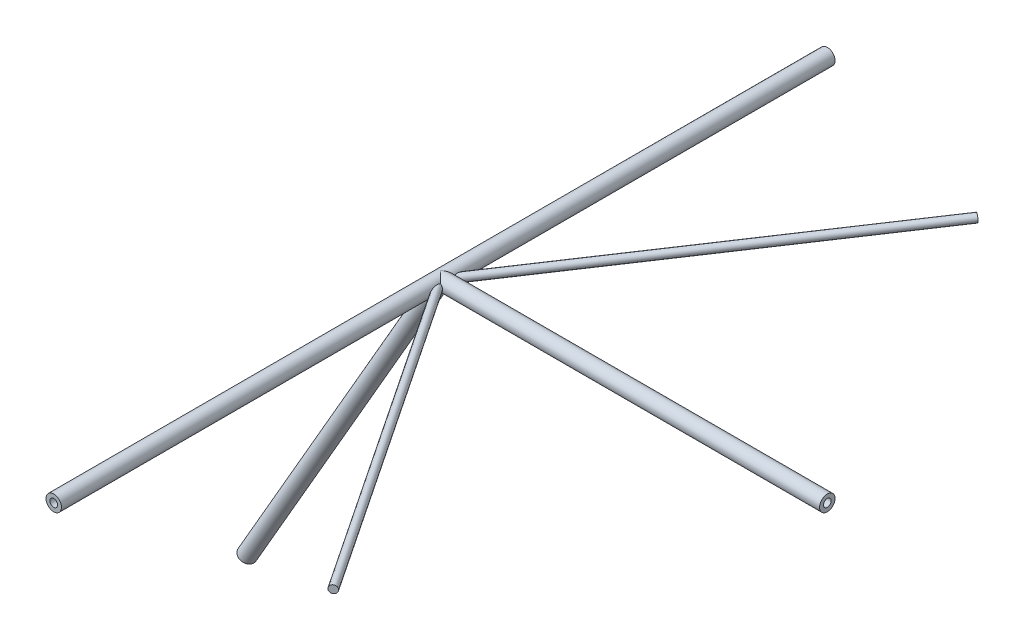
ISO-10303-21;
HEADER;
FILE_DESCRIPTION(('STEP AP214'),'2;1');
FILE_NAME('part.step','',(''),(''),'','','');
FILE_SCHEMA(('AUTOMOTIVE_DESIGN { 1 0 10303 214 1 1 1 1 }'));
ENDSEC;
DATA;
#1=APPLICATION_CONTEXT('core data for automotive mechanical design processes');
#2=APPLICATION_PROTOCOL_DEFINITION('international standard','automotive_design',2000,#1);
#3=PRODUCT_CONTEXT('',#1,'mechanical');
#4=PRODUCT('Part','Part','',(#3));
#5=PRODUCT_RELATED_PRODUCT_CATEGORY('part','',(#4));
#6=PRODUCT_DEFINITION_FORMATION('','',#4);
#7=PRODUCT_DEFINITION_CONTEXT('part definition',#1,'design');
#8=PRODUCT_DEFINITION('design','',#6,#7);
#9=PRODUCT_DEFINITION_SHAPE('','',#8);
#10=(LENGTH_UNIT() NAMED_UNIT(*) SI_UNIT(.MILLI.,.METRE.));
#11=(NAMED_UNIT(*) PLANE_ANGLE_UNIT() SI_UNIT($,.RADIAN.));
#12=(NAMED_UNIT(*) SI_UNIT($,.STERADIAN.) SOLID_ANGLE_UNIT());
#13=UNCERTAINTY_MEASURE_WITH_UNIT(LENGTH_MEASURE(1.E-05),#10,'distance_accuracy_value','');
#14=(GEOMETRIC_REPRESENTATION_CONTEXT(3) GLOBAL_UNCERTAINTY_ASSIGNED_CONTEXT((#13)) GLOBAL_UNIT_ASSIGNED_CONTEXT((#10,
#11,#12)) REPRESENTATION_CONTEXT('',''));
#15=CARTESIAN_POINT('',(0.,0.,0.));
#16=DIRECTION('',(0.,0.,1.));
#17=DIRECTION('',(1.,0.,0.));
#18=AXIS2_PLACEMENT_3D('',#15,#16,#17);
#19=CARTESIAN_POINT('',(0.,0.,-500.));
#20=DIRECTION('',(0.,0.,1.));
#21=DIRECTION('',(1.,0.,0.));
#22=AXIS2_PLACEMENT_3D('',#19,#20,#21);
#23=PLANE('',#22);
#24=CARTESIAN_POINT('',(0.,0.,-500.));
#25=DIRECTION('',(0.,0.,1.));
#26=DIRECTION('',(1.,0.,0.));
#27=AXIS2_PLACEMENT_3D('',#24,#25,#26);
#28=CIRCLE('',#27,5.);
#29=CARTESIAN_POINT('',(5.,0.,-500.));
#30=VERTEX_POINT('',#29);
#31=EDGE_CURVE('E128',#30,#30,#28,.T.);
#32=ORIENTED_EDGE('',*,*,#31,.T.);
#33=EDGE_LOOP('',(#32));
#34=FACE_BOUND('',#33,.T.);
#35=CARTESIAN_POINT('',(0.,0.,-500.));
#36=DIRECTION('',(0.,0.,1.));
#37=DIRECTION('',(1.,0.,0.));
#38=AXIS2_PLACEMENT_3D('',#35,#36,#37);
#39=CIRCLE('',#38,10.);
#40=CARTESIAN_POINT('',(10.,0.,-500.));
#41=VERTEX_POINT('',#40);
#42=EDGE_CURVE('E192',#41,#41,#39,.T.);
#43=ORIENTED_EDGE('',*,*,#42,.F.);
#44=EDGE_LOOP('',(#43));
#45=FACE_BOUND('',#44,.T.);
#46=ADVANCED_FACE('F33',(#34,#45),#23,.F.);
#47=CARTESIAN_POINT('',(0.,0.,500.));
#48=DIRECTION('',(0.,0.,1.));
#49=DIRECTION('',(1.,0.,0.));
#50=AXIS2_PLACEMENT_3D('',#47,#48,#49);
#51=PLANE('',#50);
#52=CARTESIAN_POINT('',(0.,0.,500.));
#53=DIRECTION('',(0.,0.,1.));
#54=DIRECTION('',(1.,0.,0.));
#55=AXIS2_PLACEMENT_3D('',#52,#53,#54);
#56=CIRCLE('',#55,5.);
#57=CARTESIAN_POINT('',(5.,0.,500.));
#58=VERTEX_POINT('',#57);
#59=EDGE_CURVE('E124',#58,#58,#56,.T.);
#60=ORIENTED_EDGE('',*,*,#59,.F.);
#61=EDGE_LOOP('',(#60));
#62=FACE_BOUND('',#61,.T.);
#63=CARTESIAN_POINT('',(0.,0.,500.));
#64=DIRECTION('',(0.,0.,1.));
#65=DIRECTION('',(1.,0.,0.));
#66=AXIS2_PLACEMENT_3D('',#63,#64,#65);
#67=CIRCLE('',#66,10.);
#68=CARTESIAN_POINT('',(10.,0.,500.));
#69=VERTEX_POINT('',#68);
#70=EDGE_CURVE('E195',#69,#69,#67,.T.);
#71=ORIENTED_EDGE('',*,*,#70,.T.);
#72=EDGE_LOOP('',(#71));
#73=FACE_BOUND('',#72,.T.);
#74=ADVANCED_FACE('F230',(#62,#73),#51,.T.);
#75=CARTESIAN_POINT('',(0.,0.,-500.));
#76=DIRECTION('',(0.,0.,1.));
#77=DIRECTION('',(1.,0.,0.));
#78=AXIS2_PLACEMENT_3D('',#75,#76,#77);
#79=CYLINDRICAL_SURFACE('',#78,10.);
#80=CARTESIAN_POINT('',(10.,0.,-24.0139324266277));
#81=CARTESIAN_POINT('',(9.99999652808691,0.120732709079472,-24.0139155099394));
#82=CARTESIAN_POINT('',(9.9977845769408,0.24153096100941,-24.0026295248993));
#83=CARTESIAN_POINT('',(9.98922884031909,0.479090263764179,-23.9588858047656));
#84=CARTESIAN_POINT('',(9.98287891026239,0.595845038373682,-23.9263965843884));
#85=CARTESIAN_POINT('',(9.96471008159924,0.851406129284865,-23.833131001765));
#86=CARTESIAN_POINT('',(9.95190997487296,0.988251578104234,-23.7672565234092));
#87=CARTESIAN_POINT('',(9.9225019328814,1.24954909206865,-23.6150350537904));
#88=CARTESIAN_POINT('',(9.90588547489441,1.37397251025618,-23.5286422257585));
#89=CARTESIAN_POINT('',(9.87278648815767,1.59325816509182,-23.3553550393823));
#90=CARTESIAN_POINT('',(9.85664926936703,1.68976831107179,-23.2704336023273));
#91=CARTESIAN_POINT('',(9.82309240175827,1.8750273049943,-23.092673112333));
#92=CARTESIAN_POINT('',(9.80567177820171,1.96377013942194,-22.9998280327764));
#93=CARTESIAN_POINT('',(9.7699450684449,2.13442764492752,-22.8080169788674));
#94=CARTESIAN_POINT('',(9.75163765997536,2.21633159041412,-22.7090417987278));
#95=CARTESIAN_POINT('',(9.71445494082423,2.37401032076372,-22.5063940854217));
#96=CARTESIAN_POINT('',(9.69557940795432,2.44978266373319,-22.4027197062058));
#97=CARTESIAN_POINT('',(9.65582718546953,2.60225721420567,-22.1824506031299));
#98=CARTESIAN_POINT('',(9.63491977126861,2.67846197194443,-22.0655185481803));
#99=CARTESIAN_POINT('',(9.59292147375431,2.82518418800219,-21.8281576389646));
#100=CARTESIAN_POINT('',(9.57183054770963,2.8957002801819,-21.7077279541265));
#101=CARTESIAN_POINT('',(9.50851208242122,3.09977328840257,-21.3420209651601));
#102=CARTESIAN_POINT('',(9.46626995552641,3.2257397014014,-21.0924971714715));
#103=CARTESIAN_POINT('',(9.38261213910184,3.46153503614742,-20.5846959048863));
#104=CARTESIAN_POINT('',(9.34120047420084,3.57129675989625,-20.3263871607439));
#105=CARTESIAN_POINT('',(9.26013776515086,3.77650670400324,-19.8040326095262));
#106=CARTESIAN_POINT('',(9.22048599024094,3.87196090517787,-19.5399892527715));
#107=CARTESIAN_POINT('',(9.14463476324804,4.04778327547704,-19.0147078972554));
#108=CARTESIAN_POINT('',(9.1083702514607,4.12849495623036,-18.7535934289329));
#109=CARTESIAN_POINT('',(9.0386604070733,4.27895877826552,-18.2278203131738));
#110=CARTESIAN_POINT('',(9.00521549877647,4.34870927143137,-17.9631611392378));
#111=CARTESIAN_POINT('',(8.94169045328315,4.47787368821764,-17.4306018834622));
#112=CARTESIAN_POINT('',(8.91161433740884,4.53727530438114,-17.1626983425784));
#113=CARTESIAN_POINT('',(8.8554938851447,4.64585408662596,-16.6244259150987));
#114=CARTESIAN_POINT('',(8.82944927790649,4.69503193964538,-16.354057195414));
#115=CARTESIAN_POINT('',(8.78217426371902,4.78287480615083,-15.8123837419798));
#116=CARTESIAN_POINT('',(8.76092382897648,4.82158369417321,-15.5410878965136));
#117=CARTESIAN_POINT('',(8.72385197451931,4.88833984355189,-14.9967769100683));
#118=CARTESIAN_POINT('',(8.70803111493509,4.91638600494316,-14.7237615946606));
#119=CARTESIAN_POINT('',(8.68269421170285,4.96099586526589,-14.1768809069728));
#120=CARTESIAN_POINT('',(8.67316918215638,4.97757593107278,-13.9030173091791));
#121=CARTESIAN_POINT('',(8.66134283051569,4.99812922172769,-13.3547041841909));
#122=CARTESIAN_POINT('',(8.65903927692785,5.00210634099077,-13.0802548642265));
#123=CARTESIAN_POINT('',(8.66222271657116,4.99658816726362,-12.6018316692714));
#124=CARTESIAN_POINT('',(8.66586573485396,4.99028213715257,-12.3978083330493));
#125=CARTESIAN_POINT('',(8.67816615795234,4.96886229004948,-11.9903634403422));
#126=CARTESIAN_POINT('',(8.68682332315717,4.95374889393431,-11.7869418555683));
#127=CARTESIAN_POINT('',(8.7095902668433,4.91361114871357,-11.3812371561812));
#128=CARTESIAN_POINT('',(8.72370333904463,4.88858081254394,-11.1789548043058));
#129=CARTESIAN_POINT('',(8.75776031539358,4.8273045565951,-10.7765557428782));
#130=CARTESIAN_POINT('',(8.77770430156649,4.79105847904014,-10.5764390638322));
#131=CARTESIAN_POINT('',(8.82399196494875,4.7052718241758,-10.1769087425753));
#132=CARTESIAN_POINT('',(8.85041866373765,4.65555782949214,-9.97754133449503));
#133=CARTESIAN_POINT('',(8.90956825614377,4.54133646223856,-9.58395727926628));
#134=CARTESIAN_POINT('',(8.94229190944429,4.47682730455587,-9.38974125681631));
#135=CARTESIAN_POINT('',(9.01360239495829,4.33145628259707,-9.00916962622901));
#136=CARTESIAN_POINT('',(9.0521739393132,4.25063688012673,-8.82279509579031));
#137=CARTESIAN_POINT('',(9.13437278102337,4.07099267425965,-8.46012416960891));
#138=CARTESIAN_POINT('',(9.1779969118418,3.97217912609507,-8.28382156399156));
#139=CARTESIAN_POINT('',(9.25320206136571,3.79264876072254,-8.00255628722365));
#140=CARTESIAN_POINT('',(9.28378608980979,3.71733741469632,-7.89385320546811));
#141=CARTESIAN_POINT('',(9.34587444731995,3.55835830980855,-7.68303500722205));
#142=CARTESIAN_POINT('',(9.37737851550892,3.47469290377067,-7.58091804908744));
#143=CARTESIAN_POINT('',(9.44061034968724,3.29902801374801,-7.38416489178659));
#144=CARTESIAN_POINT('',(9.47233813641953,3.207027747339,-7.28952939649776));
#145=CARTESIAN_POINT('',(9.53520172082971,3.01498387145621,-7.1086656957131));
#146=CARTESIAN_POINT('',(9.5663377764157,2.91494387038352,-7.02243375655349));
#147=CARTESIAN_POINT('',(9.62734761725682,2.70666099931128,-6.85867915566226));
#148=CARTESIAN_POINT('',(9.65721352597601,2.59837607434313,-6.78120695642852));
#149=CARTESIAN_POINT('',(9.71462425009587,2.3747417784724,-6.63622154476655));
#150=CARTESIAN_POINT('',(9.74216902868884,2.25939229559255,-6.56870849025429));
#151=CARTESIAN_POINT('',(9.79409923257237,2.02245571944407,-6.44421522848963));
#152=CARTESIAN_POINT('',(9.81848454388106,1.9008684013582,-6.38723540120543));
#153=CARTESIAN_POINT('',(9.86333532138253,1.65243524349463,-6.28426087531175));
#154=CARTESIAN_POINT('',(9.88380107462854,1.52558978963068,-6.23826537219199));
#155=CARTESIAN_POINT('',(9.91864238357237,1.27857713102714,-6.16097982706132));
#156=CARTESIAN_POINT('',(9.9333854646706,1.15874593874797,-6.12877813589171));
#157=CARTESIAN_POINT('',(9.95866588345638,0.916415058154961,-6.07402288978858));
#158=CARTESIAN_POINT('',(9.96920174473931,0.793914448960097,-6.05147272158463));
#159=CARTESIAN_POINT('',(9.9857772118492,0.54728458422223,-6.01616296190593));
#160=CARTESIAN_POINT('',(9.99181946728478,0.423156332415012,-6.00339760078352));
#161=CARTESIAN_POINT('',(9.99926084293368,0.174094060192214,-5.98769319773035));
#162=CARTESIAN_POINT('',(10.0006582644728,0.049159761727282,-5.98475775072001));
#163=CARTESIAN_POINT('',(9.99879865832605,-0.196597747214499,-5.98867416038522));
#164=CARTESIAN_POINT('',(9.99568619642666,-0.317427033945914,-5.99522202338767));
#165=CARTESIAN_POINT('',(9.98514153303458,-0.558086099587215,-6.0175343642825));
#166=CARTESIAN_POINT('',(9.97770778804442,-0.677915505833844,-6.0333021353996));
#167=CARTESIAN_POINT('',(9.95870741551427,-0.915617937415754,-6.07397485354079));
#168=CARTESIAN_POINT('',(9.94714285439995,-1.03349191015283,-6.09887523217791));
#169=CARTESIAN_POINT('',(9.92016095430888,-1.26656012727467,-6.15770416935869));
#170=CARTESIAN_POINT('',(9.90474220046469,-1.38175337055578,-6.19163604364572));
#171=CARTESIAN_POINT('',(9.87044215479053,-1.60857833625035,-6.26833059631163));
#172=CARTESIAN_POINT('',(9.85156221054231,-1.72021142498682,-6.31108983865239));
#173=CARTESIAN_POINT('',(9.81079391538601,-1.93926279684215,-6.40521944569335));
#174=CARTESIAN_POINT('',(9.7889044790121,-2.04667954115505,-6.45659291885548));
#175=CARTESIAN_POINT('',(9.74266791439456,-2.25653784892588,-6.56759628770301));
#176=CARTESIAN_POINT('',(9.71832190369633,-2.35898164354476,-6.62722243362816));
#177=CARTESIAN_POINT('',(9.66773904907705,-2.55839984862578,-6.75437054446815));
#178=CARTESIAN_POINT('',(9.64150152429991,-2.65537226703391,-6.82189535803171));
#179=CARTESIAN_POINT('',(9.58703389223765,-2.84584874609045,-6.96625878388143));
#180=CARTESIAN_POINT('',(9.55876928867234,-2.93919108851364,-7.04329792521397));
#181=CARTESIAN_POINT('',(9.50154989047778,-3.11921074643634,-7.20459123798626));
#182=CARTESIAN_POINT('',(9.47259482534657,-3.20588539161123,-7.28884827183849));
#183=CARTESIAN_POINT('',(9.38566466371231,-3.45548282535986,-7.55149646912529));
#184=CARTESIAN_POINT('',(9.32758976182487,-3.60809622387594,-7.73985441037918));
#185=CARTESIAN_POINT('',(9.23351245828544,-3.84091305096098,-8.07359155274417));
#186=CARTESIAN_POINT('',(9.19637461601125,-3.92869195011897,-8.21353447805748));
#187=CARTESIAN_POINT('',(9.12497953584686,-4.0917807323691,-8.50127997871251));
#188=CARTESIAN_POINT('',(9.09072317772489,-4.16708681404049,-8.64908493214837));
#189=CARTESIAN_POINT('',(9.02577488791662,-4.30595855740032,-8.95104063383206));
#190=CARTESIAN_POINT('',(8.99508731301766,-4.36950992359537,-9.10519883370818));
#191=CARTESIAN_POINT('',(8.93771873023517,-4.48568445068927,-9.41832647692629));
#192=CARTESIAN_POINT('',(8.91103910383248,-4.53830384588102,-9.577297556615));
#193=CARTESIAN_POINT('',(8.84899965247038,-4.65853629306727,-9.98314331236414));
#194=CARTESIAN_POINT('',(8.81642235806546,-4.71954681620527,-10.2324079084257));
#195=CARTESIAN_POINT('',(8.76096831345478,-4.82169718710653,-10.7360368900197));
#196=CARTESIAN_POINT('',(8.7380971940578,-4.86282550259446,-10.9904041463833));
#197=CARTESIAN_POINT('',(8.701394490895,-4.92819741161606,-11.5026177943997));
#198=CARTESIAN_POINT('',(8.68758867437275,-4.95239288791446,-11.7604719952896));
#199=CARTESIAN_POINT('',(8.66826645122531,-4.98613280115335,-12.2774908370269));
#200=CARTESIAN_POINT('',(8.66275316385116,-4.99567172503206,-12.5366559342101));
#201=CARTESIAN_POINT('',(8.65926915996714,-5.00170519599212,-13.0329352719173));
#202=CARTESIAN_POINT('',(8.66069259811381,-4.99924748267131,-13.2700360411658));
#203=CARTESIAN_POINT('',(8.66903906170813,-4.98475975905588,-13.7437949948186));
#204=CARTESIAN_POINT('',(8.67596120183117,-4.97273128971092,-13.9804532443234));
#205=CARTESIAN_POINT('',(8.69468565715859,-4.93991859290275,-14.4531832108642));
#206=CARTESIAN_POINT('',(8.70649263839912,-4.91912599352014,-14.6892541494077));
#207=CARTESIAN_POINT('',(8.73441471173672,-4.86937495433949,-15.1602772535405));
#208=CARTESIAN_POINT('',(8.75052993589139,-4.84041626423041,-15.3952293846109));
#209=CARTESIAN_POINT('',(8.78652771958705,-4.77475969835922,-15.8634393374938));
#210=CARTESIAN_POINT('',(8.80640532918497,-4.73807198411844,-16.0966989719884));
#211=CARTESIAN_POINT('',(8.84947713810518,-4.65712967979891,-16.5615942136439));
#212=CARTESIAN_POINT('',(8.87267138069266,-4.61287499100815,-16.7932297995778));
#213=CARTESIAN_POINT('',(8.92193727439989,-4.51685133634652,-17.2544638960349));
#214=CARTESIAN_POINT('',(8.94800697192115,-4.4650874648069,-17.4840636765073));
#215=CARTESIAN_POINT('',(9.00264588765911,-4.35387290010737,-17.9410757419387));
#216=CARTESIAN_POINT('',(9.0312148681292,-4.29442293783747,-18.1684882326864));
#217=CARTESIAN_POINT('',(9.08462060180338,-4.18005043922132,-18.5760117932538));
#218=CARTESIAN_POINT('',(9.10907680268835,-4.12656093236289,-18.7565757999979));
#219=CARTESIAN_POINT('',(9.15917665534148,-4.0141340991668,-19.1158271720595));
#220=CARTESIAN_POINT('',(9.18482024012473,-3.9551970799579,-19.2945146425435));
#221=CARTESIAN_POINT('',(9.23714163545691,-3.83141454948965,-19.6499380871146));
#222=CARTESIAN_POINT('',(9.2638206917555,-3.76656178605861,-19.8266713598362));
#223=CARTESIAN_POINT('',(9.31798493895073,-3.63049840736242,-20.1775507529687));
#224=CARTESIAN_POINT('',(9.34547011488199,-3.55928791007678,-20.3516969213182));
#225=CARTESIAN_POINT('',(9.40523137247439,-3.39853812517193,-20.7229616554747));
#226=CARTESIAN_POINT('',(9.43760361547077,-3.30785538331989,-20.9195734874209));
#227=CARTESIAN_POINT('',(9.50275484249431,-3.11575898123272,-21.3075668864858));
#228=CARTESIAN_POINT('',(9.53553399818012,-3.01434064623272,-21.4989461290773));
#229=CARTESIAN_POINT('',(9.60086099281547,-2.7992973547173,-21.8739166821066));
#230=CARTESIAN_POINT('',(9.6334092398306,-2.68571637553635,-22.0575329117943));
#231=CARTESIAN_POINT('',(9.69764979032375,-2.44362633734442,-22.4146858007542));
#232=CARTESIAN_POINT('',(9.72934303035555,-2.31513450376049,-22.5882337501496));
#233=CARTESIAN_POINT('',(9.78397261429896,-2.07024068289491,-22.8837376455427));
#234=CARTESIAN_POINT('',(9.80729261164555,-1.95747386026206,-23.0086015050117));
#235=CARTESIAN_POINT('',(9.85196588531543,-1.71860496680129,-23.2458600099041));
#236=CARTESIAN_POINT('',(9.87331589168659,-1.5924814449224,-23.358233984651));
#237=CARTESIAN_POINT('',(9.91306605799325,-1.32283867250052,-23.5660954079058));
#238=CARTESIAN_POINT('',(9.93141599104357,-1.17908242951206,-23.6612976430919));
#239=CARTESIAN_POINT('',(9.95488431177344,-0.951862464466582,-23.7825060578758));
#240=CARTESIAN_POINT('',(9.96202292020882,-0.874322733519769,-23.8192687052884));
#241=CARTESIAN_POINT('',(9.97467514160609,-0.715667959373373,-23.8843066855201));
#242=CARTESIAN_POINT('',(9.98019024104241,-0.634556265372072,-23.912589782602));
#243=CARTESIAN_POINT('',(9.98970646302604,-0.46238121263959,-23.9613343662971));
#244=CARTESIAN_POINT('',(9.99353936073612,-0.371057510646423,-23.9809282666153));
#245=CARTESIAN_POINT('',(9.99868731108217,-0.186502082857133,-24.0072330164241));
#246=CARTESIAN_POINT('',(10.0000026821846,-0.0932705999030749,-24.0139454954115));
#247=CARTESIAN_POINT('',(10.,0.,-24.0139324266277));
#248=B_SPLINE_CURVE_WITH_KNOTS('',3,(#80,#81,#82,#83,#84,#85,#86,#87,#88,#89,#90,#91,#92,#93,
#94,#95,#96,#97,#98,#99,#100,#101,#102,#103,#104,#105,#106,#107,#108,#109,#110,#111,#112,#113,
#114,#115,#116,#117,#118,#119,#120,#121,#122,#123,#124,#125,#126,#127,#128,#129,#130,#131,#132,
#133,#134,#135,#136,#137,#138,#139,#140,#141,#142,#143,#144,#145,#146,#147,#148,#149,#150,#151,
#152,#153,#154,#155,#156,#157,#158,#159,#160,#161,#162,#163,#164,#165,#166,#167,#168,#169,#170,
#171,#172,#173,#174,#175,#176,#177,#178,#179,#180,#181,#182,#183,#184,#185,#186,#187,#188,#189,
#190,#191,#192,#193,#194,#195,#196,#197,#198,#199,#200,#201,#202,#203,#204,#205,#206,#207,#208,
#209,#210,#211,#212,#213,#214,#215,#216,#217,#218,#219,#220,#221,#222,#223,#224,#225,#226,#227,
#228,#229,#230,#231,#232,#233,#234,#235,#236,#237,#238,#239,#240,#241,#242,#243,#244,#245,#246,
#247),.UNSPECIFIED.,.T.,.F.,(4,2,2,2,2,2,2,2,2,2,2,2,2,2,2,2,2,2,2,2,2,2,2,2,2,2,2,2,2,2,2,2,2,
2,2,2,2,2,2,2,2,2,2,2,2,2,2,2,2,2,2,2,2,2,2,2,2,2,2,2,2,2,2,2,2,2,2,2,2,2,2,2,2,2,2,2,2,2,2,2,2,
2,2,4),(0.,0.361803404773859,0.724145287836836,1.1788072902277,1.63449469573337,
2.02262954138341,2.41106227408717,2.80009317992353,3.18927826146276,3.61247537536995,
4.03577381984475,4.88299531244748,5.7336369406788,6.58392198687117,7.41075212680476,
8.23770646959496,9.06563765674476,9.89351319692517,10.7178634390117,11.542298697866,
12.3655547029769,13.1885562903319,13.800799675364,14.413013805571,15.0255981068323,
15.6381910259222,16.2590811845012,16.8800462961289,17.4994151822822,18.1183979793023,
18.5252275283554,18.9319428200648,19.3386963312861,19.7452682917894,20.1540744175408,
20.5628870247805,20.9717143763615,21.3805117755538,21.7549153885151,22.1294502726,
22.5037641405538,22.8782148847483,23.2409247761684,23.6037643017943,23.9664225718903,
24.3292141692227,24.691864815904,25.0546466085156,25.4172641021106,25.7800127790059,
26.1524461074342,26.525027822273,27.2697414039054,27.7770940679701,28.2846010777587,
28.7927212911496,29.3010162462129,30.0757992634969,30.8510311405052,31.6284571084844,
32.406175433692,33.117250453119,33.8282110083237,34.5398522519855,35.2515153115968,
35.9622485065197,36.6729909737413,37.3832534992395,38.0934485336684,38.663070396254,
39.2326601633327,39.8029578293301,40.3732449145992,41.0297388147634,41.6865197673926,
42.3410013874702,42.9947343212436,43.5035347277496,44.0131650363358,44.530606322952,
44.7885158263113,45.04618844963,45.3257306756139,45.6052375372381),.UNSPECIFIED.);
#249=CARTESIAN_POINT('',(9.01388261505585,-4.33011780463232,-9.01388261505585));
#250=VERTEX_POINT('',#249);
#251=CARTESIAN_POINT('',(9.01388261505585,4.33011780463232,-9.01388261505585));
#252=VERTEX_POINT('',#251);
#253=EDGE_CURVE('E138',#250,#252,#248,.T.);
#254=ORIENTED_EDGE('',*,*,#253,.F.);
#255=CARTESIAN_POINT('',(0.,0.,0.));
#256=DIRECTION('',(0.707106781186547,0.,0.707106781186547));
#257=DIRECTION('',(-0.707106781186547,0.,0.707106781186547));
#258=AXIS2_PLACEMENT_3D('',#255,#256,#257);
#259=ELLIPSE('',#258,14.1421356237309,10.);
#260=CARTESIAN_POINT('',(5.00000000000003,-8.66025403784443,-4.99999999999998));
#261=VERTEX_POINT('',#260);
#262=EDGE_CURVE('E187',#261,#250,#259,.T.);
#263=ORIENTED_EDGE('',*,*,#262,.F.);
#264=CARTESIAN_POINT('',(0.,0.,0.));
#265=DIRECTION('',(-0.353553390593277,-0.612372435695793,0.707106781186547));
#266=DIRECTION('',(0.353553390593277,0.612372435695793,0.707106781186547));
#267=AXIS2_PLACEMENT_3D('',#264,#265,#266);
#268=ELLIPSE('',#267,14.142135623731,10.);
#269=CARTESIAN_POINT('',(-8.66025403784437,4.99999999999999,0.));
#270=VERTEX_POINT('',#269);
#271=EDGE_CURVE('E200',#270,#261,#268,.T.);
#272=ORIENTED_EDGE('',*,*,#271,.F.);
#273=CARTESIAN_POINT('',(0.,0.,0.));
#274=DIRECTION('',(0.353553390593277,0.612372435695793,0.707106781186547));
#275=DIRECTION('',(-0.353553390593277,-0.612372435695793,0.707106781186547));
#276=AXIS2_PLACEMENT_3D('',#273,#274,#275);
#277=ELLIPSE('',#276,14.142135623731,10.);
#278=CARTESIAN_POINT('',(5.00000000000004,-8.66025403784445,4.99999999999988));
#279=VERTEX_POINT('',#278);
#280=EDGE_CURVE('E198',#279,#270,#277,.F.);
#281=ORIENTED_EDGE('',*,*,#280,.F.);
#282=CARTESIAN_POINT('',(0.,0.,0.));
#283=DIRECTION('',(-0.707106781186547,0.,0.707106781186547));
#284=DIRECTION('',(0.707106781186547,0.,0.707106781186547));
#285=AXIS2_PLACEMENT_3D('',#282,#283,#284);
#286=ELLIPSE('',#285,14.1421356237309,10.);
#287=CARTESIAN_POINT('',(9.01388261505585,-4.33011780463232,9.01388261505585));
#288=VERTEX_POINT('',#287);
#289=EDGE_CURVE('E183',#288,#279,#286,.F.);
#290=ORIENTED_EDGE('',*,*,#289,.F.);
#291=CARTESIAN_POINT('',(10.,0.,5.98614417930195));
#292=CARTESIAN_POINT('',(9.99999989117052,0.122217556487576,5.98614425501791));
#293=CARTESIAN_POINT('',(9.99775464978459,0.244437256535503,5.99086368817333));
#294=CARTESIAN_POINT('',(9.9888281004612,0.488031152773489,6.00972422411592));
#295=CARTESIAN_POINT('',(9.98214506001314,0.609405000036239,6.02386900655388));
#296=CARTESIAN_POINT('',(9.96451245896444,0.850339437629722,6.06151258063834));
#297=CARTESIAN_POINT('',(9.95356424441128,0.969900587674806,6.08500842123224));
#298=CARTESIAN_POINT('',(9.92767248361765,1.20643260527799,6.14124978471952));
#299=CARTESIAN_POINT('',(9.91272743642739,1.3234024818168,6.17399878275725));
#300=CARTESIAN_POINT('',(9.87924172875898,1.55374134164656,6.2485248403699));
#301=CARTESIAN_POINT('',(9.86070539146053,1.66711446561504,6.29029105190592));
#302=CARTESIAN_POINT('',(9.82048476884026,1.88967536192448,6.38265110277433));
#303=CARTESIAN_POINT('',(9.79879932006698,1.99886156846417,6.43324820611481));
#304=CARTESIAN_POINT('',(9.75283924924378,2.21224628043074,6.54291456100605));
#305=CARTESIAN_POINT('',(9.72856597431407,2.31644734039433,6.60197941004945));
#306=CARTESIAN_POINT('',(9.67800787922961,2.51934538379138,6.72822237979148));
#307=CARTESIAN_POINT('',(9.65172233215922,2.61804035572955,6.7954034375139));
#308=CARTESIAN_POINT('',(9.59737213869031,2.81080521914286,6.93844293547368));
#309=CARTESIAN_POINT('',(9.56928689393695,2.90478485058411,7.01441525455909));
#310=CARTESIAN_POINT('',(9.51234814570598,3.08614197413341,7.17362657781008));
#311=CARTESIAN_POINT('',(9.48349434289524,3.17351684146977,7.25686844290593));
#312=CARTESIAN_POINT('',(9.3967546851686,3.42527730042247,7.51655877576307));
#313=CARTESIAN_POINT('',(9.33865328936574,3.57942587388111,7.70306725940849));
#314=CARTESIAN_POINT('',(9.2445776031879,3.81421289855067,8.03302982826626));
#315=CARTESIAN_POINT('',(9.20752352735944,3.90250345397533,8.17090406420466));
#316=CARTESIAN_POINT('',(9.13615860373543,4.06677040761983,8.45455118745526));
#317=CARTESIAN_POINT('',(9.1018485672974,4.14274317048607,8.60032638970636));
#318=CARTESIAN_POINT('',(9.0366675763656,4.28306433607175,8.89829080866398));
#319=CARTESIAN_POINT('',(9.00580097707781,4.34739808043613,9.05048781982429));
#320=CARTESIAN_POINT('',(8.94796991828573,4.46521280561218,9.35976798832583));
#321=CARTESIAN_POINT('',(8.92100679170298,4.518690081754,9.51685279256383));
#322=CARTESIAN_POINT('',(8.8583716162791,4.64070648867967,9.91659099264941));
#323=CARTESIAN_POINT('',(8.82536935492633,4.70281143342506,10.161635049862));
#324=CARTESIAN_POINT('',(8.76882315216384,4.80741411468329,10.656944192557));
#325=CARTESIAN_POINT('',(8.74528459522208,4.84990069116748,10.9072121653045));
#326=CARTESIAN_POINT('',(8.70707356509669,4.91816946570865,11.4112532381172));
#327=CARTESIAN_POINT('',(8.69242299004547,4.94391041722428,11.6650334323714));
#328=CARTESIAN_POINT('',(8.67127802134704,4.98090127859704,12.1740298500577));
#329=CARTESIAN_POINT('',(8.66478670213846,4.99214572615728,12.4292465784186));
#330=CARTESIAN_POINT('',(8.65934676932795,5.0015724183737,12.9177134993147));
#331=CARTESIAN_POINT('',(8.65979025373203,5.00080738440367,13.1509401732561));
#332=CARTESIAN_POINT('',(8.66610811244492,4.98985054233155,13.6170457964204));
#333=CARTESIAN_POINT('',(8.6719816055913,4.97966026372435,13.8499247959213));
#334=CARTESIAN_POINT('',(8.68856001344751,4.95067682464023,14.3151794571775));
#335=CARTESIAN_POINT('',(8.69926942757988,4.93187565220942,14.5475544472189));
#336=CARTESIAN_POINT('',(8.72496555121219,4.88627261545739,15.0112800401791));
#337=CARTESIAN_POINT('',(8.73995240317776,4.85947048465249,15.2426306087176));
#338=CARTESIAN_POINT('',(8.77370701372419,4.79825874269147,15.7041358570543));
#339=CARTESIAN_POINT('',(8.79247629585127,4.76384606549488,15.9342900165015));
#340=CARTESIAN_POINT('',(8.83333741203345,4.68764541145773,16.3930782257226));
#341=CARTESIAN_POINT('',(8.8554293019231,4.64585731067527,16.621712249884));
#342=CARTESIAN_POINT('',(8.90250817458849,4.55499355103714,17.0770813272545));
#343=CARTESIAN_POINT('',(8.92749339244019,4.50592232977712,17.3038174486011));
#344=CARTESIAN_POINT('',(8.97998896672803,4.40037182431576,17.7552482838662));
#345=CARTESIAN_POINT('',(9.0074991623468,4.34389301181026,17.9799431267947));
#346=CARTESIAN_POINT('',(9.0688571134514,4.21446202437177,18.4595506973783));
#347=CARTESIAN_POINT('',(9.10304431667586,4.14030864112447,18.7140976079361));
#348=CARTESIAN_POINT('',(9.17375571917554,3.98118016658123,19.219490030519));
#349=CARTESIAN_POINT('',(9.21028006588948,3.89620439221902,19.4703353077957));
#350=CARTESIAN_POINT('',(9.28509202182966,3.71439422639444,19.9670891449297));
#351=CARTESIAN_POINT('',(9.32337741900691,3.61757447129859,20.213003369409));
#352=CARTESIAN_POINT('',(9.4011694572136,3.41032309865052,20.6988141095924));
#353=CARTESIAN_POINT('',(9.44067570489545,3.29989583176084,20.9387125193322));
#354=CARTESIAN_POINT('',(9.50503353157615,3.10810001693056,21.3204118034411));
#355=CARTESIAN_POINT('',(9.5297294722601,3.03170516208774,21.4647403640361));
#356=CARTESIAN_POINT('',(9.57909278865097,2.8719303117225,21.7494694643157));
#357=CARTESIAN_POINT('',(9.60376016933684,2.78855181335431,21.8898708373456));
#358=CARTESIAN_POINT('',(9.6527682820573,2.6138654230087,22.1655575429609));
#359=CARTESIAN_POINT('',(9.67710930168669,2.52256512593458,22.3008476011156));
#360=CARTESIAN_POINT('',(9.72509468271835,2.33073072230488,22.564791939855));
#361=CARTESIAN_POINT('',(9.74873941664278,2.23020167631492,22.6934497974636));
#362=CARTESIAN_POINT('',(9.79738270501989,2.00645562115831,22.9557320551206));
#363=CARTESIAN_POINT('',(9.82223773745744,1.88195867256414,23.0883075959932));
#364=CARTESIAN_POINT('',(9.86930667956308,1.61705240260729,23.3372756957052));
#365=CARTESIAN_POINT('',(9.89152319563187,1.47665905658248,23.4536842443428));
#366=CARTESIAN_POINT('',(9.92652846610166,1.21522991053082,23.6359466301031));
#367=CARTESIAN_POINT('',(9.94028602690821,1.0981172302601,23.7071654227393));
#368=CARTESIAN_POINT('',(9.96422499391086,0.853917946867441,23.8306606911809));
#369=CARTESIAN_POINT('',(9.97441313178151,0.726850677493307,23.8829728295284));
#370=CARTESIAN_POINT('',(9.98859057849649,0.489326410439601,23.9556328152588));
#371=CARTESIAN_POINT('',(9.99338244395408,0.380202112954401,23.9801268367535));
#372=CARTESIAN_POINT('',(9.9993396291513,0.159301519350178,24.0105657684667));
#373=CARTESIAN_POINT('',(10.0005077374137,0.0475273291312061,24.0165249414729));
#374=CARTESIAN_POINT('',(9.99908352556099,-0.175391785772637,24.0092530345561));
#375=CARTESIAN_POINT('',(9.99648991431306,-0.286536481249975,23.9960153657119));
#376=CARTESIAN_POINT('',(9.98783745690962,-0.50508186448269,23.9517652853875));
#377=CARTESIAN_POINT('',(9.98177541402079,-0.612479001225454,23.9207364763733));
#378=CARTESIAN_POINT('',(9.96409756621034,-0.85841404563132,23.8299804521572));
#379=CARTESIAN_POINT('',(9.95127568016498,-0.994527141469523,23.763983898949));
#380=CARTESIAN_POINT('',(9.92187135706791,-1.2544787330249,23.6117600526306));
#381=CARTESIAN_POINT('',(9.90527956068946,-1.3782855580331,23.5254823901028));
#382=CARTESIAN_POINT('',(9.8721485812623,-1.59721968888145,23.3520042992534));
#383=CARTESIAN_POINT('',(9.85593825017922,-1.69392057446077,23.2666842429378));
#384=CARTESIAN_POINT('',(9.82223456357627,-1.87952520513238,23.088110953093));
#385=CARTESIAN_POINT('',(9.80474021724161,-1.96842281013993,22.9948515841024));
#386=CARTESIAN_POINT('',(9.7688667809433,-2.13936358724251,22.8022013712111));
#387=CARTESIAN_POINT('',(9.75048635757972,-2.22139588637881,22.7028012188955));
#388=CARTESIAN_POINT('',(9.71315969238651,-2.37930867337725,22.4992984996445));
#389=CARTESIAN_POINT('',(9.6942132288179,-2.45518670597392,22.3951940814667));
#390=CARTESIAN_POINT('',(9.65430213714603,-2.60791491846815,22.1739482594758));
#391=CARTESIAN_POINT('',(9.63330677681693,-2.68426168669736,22.0564663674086));
#392=CARTESIAN_POINT('',(9.59113637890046,-2.83124240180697,21.8179994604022));
#393=CARTESIAN_POINT('',(9.56996129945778,-2.90187497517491,21.6970136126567));
#394=CARTESIAN_POINT('',(9.50639710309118,-3.10626507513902,21.3296301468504));
#395=CARTESIAN_POINT('',(9.4640003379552,-3.2323992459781,21.0789792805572));
#396=CARTESIAN_POINT('',(9.38005740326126,-3.4684579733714,20.5689132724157));
#397=CARTESIAN_POINT('',(9.3385153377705,-3.57831533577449,20.3094669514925));
#398=CARTESIAN_POINT('',(9.25722129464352,-3.78365309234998,19.7848298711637));
#399=CARTESIAN_POINT('',(9.21746857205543,-3.87913950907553,19.5196415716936));
#400=CARTESIAN_POINT('',(9.14158510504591,-4.05465897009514,18.9930117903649));
#401=CARTESIAN_POINT('',(9.1053802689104,-4.13507941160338,18.7317091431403));
#402=CARTESIAN_POINT('',(9.03580739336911,-4.28497463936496,18.205576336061));
#403=CARTESIAN_POINT('',(9.00243977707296,-4.35444779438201,17.9407456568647));
#404=CARTESIAN_POINT('',(8.93908829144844,-4.4830615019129,17.4078552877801));
#405=CARTESIAN_POINT('',(8.90910846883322,-4.54218974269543,17.1397921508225));
#406=CARTESIAN_POINT('',(8.85320163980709,-4.65021688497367,16.6012106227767));
#407=CARTESIAN_POINT('',(8.82727436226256,-4.69911647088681,16.3306923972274));
#408=CARTESIAN_POINT('',(8.78025819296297,-4.78638812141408,15.7887405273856));
#409=CARTESIAN_POINT('',(8.75914899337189,-4.82480451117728,15.517315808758));
#410=CARTESIAN_POINT('',(8.7223861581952,-4.89095221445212,14.9727577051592));
#411=CARTESIAN_POINT('',(8.70673309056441,-4.91868241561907,14.6996241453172));
#412=CARTESIAN_POINT('',(8.68176188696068,-4.96262531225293,14.1525240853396));
#413=CARTESIAN_POINT('',(8.67243465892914,-4.97885453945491,13.878559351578));
#414=CARTESIAN_POINT('',(8.66103765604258,-4.99865705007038,13.3300648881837));
#415=CARTESIAN_POINT('',(8.65896561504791,-5.00223428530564,13.0555353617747));
#416=CARTESIAN_POINT('',(8.6625790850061,-4.99597048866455,12.5777403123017));
#417=CARTESIAN_POINT('',(8.66639583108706,-4.98936232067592,12.3744177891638));
#418=CARTESIAN_POINT('',(8.6790262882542,-4.96736061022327,11.9683915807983));
#419=CARTESIAN_POINT('',(8.6878397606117,-4.95196748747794,11.7656878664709));
#420=CARTESIAN_POINT('',(8.71089646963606,-4.91129655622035,11.3614388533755));
#421=CARTESIAN_POINT('',(8.72514293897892,-4.88601286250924,11.1598943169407));
#422=CARTESIAN_POINT('',(8.7594372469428,-4.82426291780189,10.7589883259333));
#423=CARTESIAN_POINT('',(8.77948516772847,-4.78779650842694,10.5596269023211));
#424=CARTESIAN_POINT('',(8.82594384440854,-4.70161179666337,10.1616430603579));
#425=CARTESIAN_POINT('',(8.85243680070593,-4.65172133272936,9.96306690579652));
#426=CARTESIAN_POINT('',(8.91167260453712,-4.53720771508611,9.57107529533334));
#427=CARTESIAN_POINT('',(8.9444161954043,-4.47258280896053,9.37766045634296));
#428=CARTESIAN_POINT('',(9.01571485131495,-4.32705882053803,8.99868301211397));
#429=CARTESIAN_POINT('',(9.05425488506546,-4.24620165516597,8.8131016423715));
#430=CARTESIAN_POINT('',(9.13633680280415,-4.0665821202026,8.45199534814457));
#431=CARTESIAN_POINT('',(9.17987558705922,-3.96783082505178,8.27646429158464));
#432=CARTESIAN_POINT('',(9.2549848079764,-3.7882988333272,7.99611898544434));
#433=CARTESIAN_POINT('',(9.28557618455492,-3.71286618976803,7.8875944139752));
#434=CARTESIAN_POINT('',(9.34766572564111,-3.55365264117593,7.6771437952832));
#435=CARTESIAN_POINT('',(9.37916363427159,-3.46987407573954,7.57521591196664));
#436=CARTESIAN_POINT('',(9.44237001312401,-3.29399102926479,7.37884568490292));
#437=CARTESIAN_POINT('',(9.47407851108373,-3.20188543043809,7.28440434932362));
#438=CARTESIAN_POINT('',(9.53688896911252,-3.00964541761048,7.10393578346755));
#439=CARTESIAN_POINT('',(9.56799119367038,-2.90951460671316,7.01790481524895));
#440=CARTESIAN_POINT('',(9.62892091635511,-2.70106163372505,6.85455292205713));
#441=CARTESIAN_POINT('',(9.65874038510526,-2.59269710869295,6.7772829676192));
#442=CARTESIAN_POINT('',(9.71604584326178,-2.36892143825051,6.63270315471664));
#443=CARTESIAN_POINT('',(9.74353177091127,-2.25351010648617,6.56539355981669));
#444=CARTESIAN_POINT('',(9.79532875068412,-2.0164933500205,6.44131820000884));
#445=CARTESIAN_POINT('',(9.8196402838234,-1.89488886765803,6.38455083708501));
#446=CARTESIAN_POINT('',(9.86433634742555,-1.64644760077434,6.28199523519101));
#447=CARTESIAN_POINT('',(9.88472133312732,-1.51961142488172,6.23620572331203));
#448=CARTESIAN_POINT('',(9.91850884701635,-1.2790265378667,6.16129270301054));
#449=CARTESIAN_POINT('',(9.9324804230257,-1.16579380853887,6.1307597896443));
#450=CARTESIAN_POINT('',(9.95667752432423,-0.936917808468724,6.07831045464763));
#451=CARTESIAN_POINT('',(9.96690199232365,-0.821273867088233,6.05639646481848));
#452=CARTESIAN_POINT('',(9.98335328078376,-0.588447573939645,6.02130798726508));
#453=CARTESIAN_POINT('',(9.98958212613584,-0.471266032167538,6.00812907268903));
#454=CARTESIAN_POINT('',(9.99790630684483,-0.236057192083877,5.99054550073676));
#455=CARTESIAN_POINT('',(10.0000001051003,-0.118029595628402,5.98614410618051));
#456=CARTESIAN_POINT('',(10.,0.,5.98614417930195));
#457=B_SPLINE_CURVE_WITH_KNOTS('',3,(#291,#292,#293,#294,#295,#296,#297,#298,#299,#300,#301,
#302,#303,#304,#305,#306,#307,#308,#309,#310,#311,#312,#313,#314,#315,#316,#317,#318,#319,#320,
#321,#322,#323,#324,#325,#326,#327,#328,#329,#330,#331,#332,#333,#334,#335,#336,#337,#338,#339,
#340,#341,#342,#343,#344,#345,#346,#347,#348,#349,#350,#351,#352,#353,#354,#355,#356,#357,#358,
#359,#360,#361,#362,#363,#364,#365,#366,#367,#368,#369,#370,#371,#372,#373,#374,#375,#376,#377,
#378,#379,#380,#381,#382,#383,#384,#385,#386,#387,#388,#389,#390,#391,#392,#393,#394,#395,#396,
#397,#398,#399,#400,#401,#402,#403,#404,#405,#406,#407,#408,#409,#410,#411,#412,#413,#414,#415,
#416,#417,#418,#419,#420,#421,#422,#423,#424,#425,#426,#427,#428,#429,#430,#431,#432,#433,#434,
#435,#436,#437,#438,#439,#440,#441,#442,#443,#444,#445,#446,#447,#448,#449,#450,#451,#452,#453,
#454,#455,#456),.UNSPECIFIED.,.T.,.F.,(4,2,2,2,2,2,2,2,2,2,2,2,2,2,2,2,2,2,2,2,2,2,2,2,2,2,2,2,
2,2,2,2,2,2,2,2,2,2,2,2,2,2,2,2,2,2,2,2,2,2,2,2,2,2,2,2,2,2,2,2,2,2,2,2,2,2,2,2,2,2,2,2,2,2,2,2,
2,2,2,2,2,2,4),(0.,0.366544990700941,0.733233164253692,1.09980570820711,1.46651610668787,
1.83278777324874,2.19919510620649,2.56541262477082,2.93176306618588,3.30354474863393,
3.67547341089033,4.41884642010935,4.92183967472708,5.42498110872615,5.92875186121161,
6.43269423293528,7.19626173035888,7.96026305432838,8.72613915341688,9.49230375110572,
10.1917141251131,10.8910110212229,11.5909598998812,12.2909320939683,12.9911867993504,
13.6914532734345,14.3912948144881,15.0910918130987,15.8928220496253,16.6946029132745,
17.4954027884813,18.2959472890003,18.7912616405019,19.2864700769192,19.7812088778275,
20.2756779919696,20.8253454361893,21.3744653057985,21.7864357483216,22.197625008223,
22.5319830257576,22.866083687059,23.2002990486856,23.5348229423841,23.9876942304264,
24.4417023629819,24.8310694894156,25.2207402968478,25.6110170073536,26.0014486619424,
26.4262811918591,26.8512155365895,27.7017127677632,28.5556286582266,29.4091856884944,
30.2362730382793,31.0634835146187,31.8916718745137,32.7198048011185,33.5443799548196,
34.3690409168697,35.1925140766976,36.0157300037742,36.6259111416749,37.2360631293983,
37.8465787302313,38.4571029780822,39.0758646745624,39.6947000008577,40.3119573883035,
40.9288340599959,41.3354416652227,41.7419356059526,42.1484841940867,42.55485126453,
42.9634728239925,43.3721051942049,43.7806755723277,44.1891985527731,44.543131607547,
44.8971644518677,45.2510177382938,45.6050025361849),.UNSPECIFIED.);
#458=CARTESIAN_POINT('',(9.01388261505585,4.33011780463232,9.01388261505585));
#459=VERTEX_POINT('',#458);
#460=EDGE_CURVE('E174',#459,#288,#457,.T.);
#461=ORIENTED_EDGE('',*,*,#460,.F.);
#462=CARTESIAN_POINT('',(0.,9.99999999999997,0.));
#463=VERTEX_POINT('',#462);
#464=EDGE_CURVE('E184',#463,#459,#286,.F.);
#465=ORIENTED_EDGE('',*,*,#464,.F.);
#466=EDGE_CURVE('E186',#252,#463,#259,.T.);
#467=ORIENTED_EDGE('',*,*,#466,.F.);
#468=EDGE_LOOP('',(#254,#263,#272,#281,#290,#461,#465,#467));
#469=FACE_BOUND('',#468,.T.);
#470=ORIENTED_EDGE('',*,*,#70,.F.);
#471=EDGE_LOOP('',(#470));
#472=FACE_BOUND('',#471,.T.);
#473=ORIENTED_EDGE('',*,*,#42,.T.);
#474=EDGE_LOOP('',(#473));
#475=FACE_BOUND('',#474,.T.);
#476=ADVANCED_FACE('F147',(#469,#472,#475),#79,.T.);
#477=CARTESIAN_POINT('',(-250.000000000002,-433.012701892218,0.));
#478=DIRECTION('',(-0.500000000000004,-0.866025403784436,0.));
#479=DIRECTION('',(0.866025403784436,-0.500000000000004,0.));
#480=AXIS2_PLACEMENT_3D('',#477,#478,#479);
#481=PLANE('',#480);
#482=CARTESIAN_POINT('',(-250.000000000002,-433.012701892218,0.));
#483=DIRECTION('',(-0.500000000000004,-0.866025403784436,0.));
#484=DIRECTION('',(0.866025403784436,-0.500000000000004,0.));
#485=AXIS2_PLACEMENT_3D('',#482,#483,#484);
#486=CIRCLE('',#485,5.00000000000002);
#487=CARTESIAN_POINT('',(-245.66987298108,-435.512701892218,0.));
#488=VERTEX_POINT('',#487);
#489=EDGE_CURVE('E113',#488,#488,#486,.T.);
#490=ORIENTED_EDGE('',*,*,#489,.F.);
#491=EDGE_LOOP('',(#490));
#492=FACE_BOUND('',#491,.T.);
#493=CARTESIAN_POINT('',(-250.000000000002,-433.012701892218,0.));
#494=DIRECTION('',(-0.500000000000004,-0.866025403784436,0.));
#495=DIRECTION('',(0.866025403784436,-0.500000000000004,0.));
#496=AXIS2_PLACEMENT_3D('',#493,#494,#495);
#497=CIRCLE('',#496,10.);
#498=CARTESIAN_POINT('',(-241.339745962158,-438.012701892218,0.));
#499=VERTEX_POINT('',#498);
#500=EDGE_CURVE('E189',#499,#499,#497,.T.);
#501=ORIENTED_EDGE('',*,*,#500,.T.);
#502=EDGE_LOOP('',(#501));
#503=FACE_BOUND('',#502,.T.);
#504=ADVANCED_FACE('F221',(#492,#503),#481,.T.);
#505=CARTESIAN_POINT('',(0.,0.,0.));
#506=DIRECTION('',(-0.500000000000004,-0.866025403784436,0.));
#507=DIRECTION('',(0.866025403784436,-0.500000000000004,0.));
#508=AXIS2_PLACEMENT_3D('',#505,#506,#507);
#509=CYLINDRICAL_SURFACE('',#508,10.);
#510=CARTESIAN_POINT('',(0.,0.,0.));
#511=DIRECTION('',(-0.86602540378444,-0.499999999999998,0.));
#512=DIRECTION('',(0.499999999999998,-0.86602540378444,0.));
#513=AXIS2_PLACEMENT_3D('',#510,#511,#512);
#514=ELLIPSE('',#513,11.5470053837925,10.);
#515=EDGE_CURVE('E201',#279,#261,#514,.F.);
#516=ORIENTED_EDGE('',*,*,#515,.F.);
#517=ORIENTED_EDGE('',*,*,#280,.T.);
#518=ORIENTED_EDGE('',*,*,#271,.T.);
#519=EDGE_LOOP('',(#516,#517,#518));
#520=FACE_BOUND('',#519,.T.);
#521=ORIENTED_EDGE('',*,*,#500,.F.);
#522=EDGE_LOOP('',(#521));
#523=FACE_BOUND('',#522,.T.);
#524=ADVANCED_FACE('F215',(#520,#523),#509,.T.);
#525=CARTESIAN_POINT('',(500.,0.,0.));
#526=DIRECTION('',(1.,0.,0.));
#527=DIRECTION('',(0.,0.,-1.));
#528=AXIS2_PLACEMENT_3D('',#525,#526,#527);
#529=PLANE('',#528);
#530=CARTESIAN_POINT('',(500.,0.,0.));
#531=DIRECTION('',(1.,0.,0.));
#532=DIRECTION('',(0.,0.,-1.));
#533=AXIS2_PLACEMENT_3D('',#530,#531,#532);
#534=CIRCLE('',#533,5.);
#535=CARTESIAN_POINT('',(500.,0.,-5.));
#536=VERTEX_POINT('',#535);
#537=EDGE_CURVE('E133',#536,#536,#534,.T.);
#538=ORIENTED_EDGE('',*,*,#537,.F.);
#539=EDGE_LOOP('',(#538));
#540=FACE_BOUND('',#539,.T.);
#541=CARTESIAN_POINT('',(500.,0.,0.));
#542=DIRECTION('',(1.,0.,0.));
#543=DIRECTION('',(0.,0.,-1.));
#544=AXIS2_PLACEMENT_3D('',#541,#542,#543);
#545=CIRCLE('',#544,10.);
#546=CARTESIAN_POINT('',(500.,0.,-10.));
#547=VERTEX_POINT('',#546);
#548=EDGE_CURVE('E180',#547,#547,#545,.T.);
#549=ORIENTED_EDGE('',*,*,#548,.T.);
#550=EDGE_LOOP('',(#549));
#551=FACE_BOUND('',#550,.T.);
#552=ADVANCED_FACE('F168',(#540,#551),#529,.T.);
#553=CARTESIAN_POINT('',(0.,0.,0.));
#554=DIRECTION('',(1.,0.,0.));
#555=DIRECTION('',(0.,0.,-1.));
#556=AXIS2_PLACEMENT_3D('',#553,#554,#555);
#557=CYLINDRICAL_SURFACE('',#556,10.);
#558=CARTESIAN_POINT('',(0.65740223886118,0.,-10.));
#559=CARTESIAN_POINT('',(0.657402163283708,0.139606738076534,-10.0000001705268));
#560=CARTESIAN_POINT('',(0.662480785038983,0.279210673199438,-9.99707102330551));
#561=CARTESIAN_POINT('',(0.682793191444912,0.557485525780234,-9.98541979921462));
#562=CARTESIAN_POINT('',(0.698030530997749,0.69615609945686,-9.97669569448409));
#563=CARTESIAN_POINT('',(0.738637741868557,0.97147034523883,-9.95365859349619));
#564=CARTESIAN_POINT('',(0.764002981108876,1.10811491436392,-9.93934815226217));
#565=CARTESIAN_POINT('',(0.824846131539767,1.37851985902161,-9.90546596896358));
#566=CARTESIAN_POINT('',(0.860327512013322,1.51227922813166,-9.88589242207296));
#567=CARTESIAN_POINT('',(0.941369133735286,1.77596448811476,-9.84194205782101));
#568=CARTESIAN_POINT('',(0.986933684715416,1.90588871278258,-9.81756318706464));
#569=CARTESIAN_POINT('',(1.088059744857,2.16089951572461,-9.76460302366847));
#570=CARTESIAN_POINT('',(1.14362107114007,2.28598618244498,-9.73602180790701));
#571=CARTESIAN_POINT('',(1.2646456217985,2.53042870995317,-9.67537040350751));
#572=CARTESIAN_POINT('',(1.33011096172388,2.6497833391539,-9.64329946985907));
#573=CARTESIAN_POINT('',(1.47074525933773,2.88179186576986,-9.5765256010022));
#574=CARTESIAN_POINT('',(1.54591038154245,2.99444838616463,-9.54182370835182));
#575=CARTESIAN_POINT('',(1.70473625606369,3.21090643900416,-9.47116062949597));
#576=CARTESIAN_POINT('',(1.78828056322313,3.31480018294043,-9.43522030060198));
#577=CARTESIAN_POINT('',(1.96425325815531,3.51444911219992,-9.36268793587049));
#578=CARTESIAN_POINT('',(2.05667799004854,3.61020761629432,-9.32609617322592));
#579=CARTESIAN_POINT('',(2.24995332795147,3.7929088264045,-9.2532974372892));
#580=CARTESIAN_POINT('',(2.35080147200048,3.87985409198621,-9.21709035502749));
#581=CARTESIAN_POINT('',(2.56033801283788,4.04436957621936,-9.14609780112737));
#582=CARTESIAN_POINT('',(2.66902608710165,4.12194018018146,-9.11131227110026));
#583=CARTESIAN_POINT('',(2.88880945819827,4.26424161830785,-9.04555875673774));
#584=CARTESIAN_POINT('',(2.9996167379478,4.32937222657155,-9.01449217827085));
#585=CARTESIAN_POINT('',(3.226974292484,4.45040125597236,-8.95535972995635));
#586=CARTESIAN_POINT('',(3.34352647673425,4.50629658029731,-8.92729486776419));
#587=CARTESIAN_POINT('',(3.58140501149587,4.60873152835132,-8.87484721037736));
#588=CARTESIAN_POINT('',(3.70272919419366,4.65527534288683,-8.85046276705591));
#589=CARTESIAN_POINT('',(3.94927994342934,4.73914708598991,-8.80583433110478));
#590=CARTESIAN_POINT('',(4.07450795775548,4.7764715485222,-8.78559189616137));
#591=CARTESIAN_POINT('',(4.45611106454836,4.87530403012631,-8.73139570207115));
#592=CARTESIAN_POINT('',(4.717126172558,4.92313188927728,-8.7042591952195));
#593=CARTESIAN_POINT('',(5.24422946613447,4.9855438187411,-8.66865494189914));
#594=CARTESIAN_POINT('',(5.51032128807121,5.00010308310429,-8.66020112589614));
#595=CARTESIAN_POINT('',(5.97776642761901,4.99992095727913,-8.66029467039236));
#596=CARTESIAN_POINT('',(6.1791800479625,4.99142565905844,-8.66521820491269));
#597=CARTESIAN_POINT('',(6.58044366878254,4.95912960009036,-8.68374286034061));
#598=CARTESIAN_POINT('',(6.78029290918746,4.93532181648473,-8.69734796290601));
#599=CARTESIAN_POINT('',(7.17752979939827,4.87359871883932,-8.7320834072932));
#600=CARTESIAN_POINT('',(7.37491138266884,4.83565381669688,-8.75322952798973));
#601=CARTESIAN_POINT('',(7.76584457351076,4.74661204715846,-8.80183187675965));
#602=CARTESIAN_POINT('',(7.95939665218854,4.69551680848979,-8.82928732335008));
#603=CARTESIAN_POINT('',(8.3471291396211,4.57921896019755,-8.89017315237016));
#604=CARTESIAN_POINT('',(8.54118297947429,4.51366990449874,-8.92374594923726));
#605=CARTESIAN_POINT('',(8.92364969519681,4.36964166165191,-8.99514842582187));
#606=CARTESIAN_POINT('',(9.11206189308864,4.29116092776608,-9.03297861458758));
#607=CARTESIAN_POINT('',(9.48212439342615,4.12133861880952,-9.11171348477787));
#608=CARTESIAN_POINT('',(9.66378074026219,4.03000890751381,-9.15261531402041));
#609=CARTESIAN_POINT('',(10.019326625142,3.83413987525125,-9.23638041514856));
#610=CARTESIAN_POINT('',(10.1932181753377,3.7296040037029,-9.27924317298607));
#611=CARTESIAN_POINT('',(10.4905938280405,3.53380771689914,-9.35523291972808));
#612=CARTESIAN_POINT('',(10.6160581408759,3.44549484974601,-9.38819447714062));
#613=CARTESIAN_POINT('',(10.8607872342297,3.26062415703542,-9.45399137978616));
#614=CARTESIAN_POINT('',(10.9800506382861,3.16406451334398,-9.48682669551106));
#615=CARTESIAN_POINT('',(11.3266759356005,2.86163685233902,-9.58415119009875));
#616=CARTESIAN_POINT('',(11.543432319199,2.64266101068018,-9.64760478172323));
#617=CARTESIAN_POINT('',(11.8803908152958,2.23403063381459,-9.74885342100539));
#618=CARTESIAN_POINT('',(12.0106587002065,2.0532420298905,-9.78886777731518));
#619=CARTESIAN_POINT('',(12.2424153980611,1.67253711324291,-9.86103223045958));
#620=CARTESIAN_POINT('',(12.3439496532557,1.47265167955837,-9.89319473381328));
#621=CARTESIAN_POINT('',(12.4946254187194,1.09517949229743,-9.94131472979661));
#622=CARTESIAN_POINT('',(12.5499945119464,0.920343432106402,-9.9591722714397));
#623=CARTESIAN_POINT('',(12.632034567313,0.563371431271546,-9.98571655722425));
#624=CARTESIAN_POINT('',(12.658729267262,0.381241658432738,-9.99441088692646));
#625=CARTESIAN_POINT('',(12.6810525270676,0.0142864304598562,-10.0016776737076));
#626=CARTESIAN_POINT('',(12.6765860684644,-0.170545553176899,-10.0002191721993));
#627=CARTESIAN_POINT('',(12.6367951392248,-0.536497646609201,-9.98727916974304));
#628=CARTESIAN_POINT('',(12.6014573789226,-0.71761612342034,-9.97579335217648));
#629=CARTESIAN_POINT('',(12.5048774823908,-1.06462554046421,-9.94463968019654));
#630=CARTESIAN_POINT('',(12.4446424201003,-1.230831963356,-9.92529035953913));
#631=CARTESIAN_POINT('',(12.3024490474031,-1.55259098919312,-9.88007650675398));
#632=CARTESIAN_POINT('',(12.2204822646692,-1.70813940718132,-9.85420943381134));
#633=CARTESIAN_POINT('',(11.9836623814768,-2.09825796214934,-9.78045115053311));
#634=CARTESIAN_POINT('',(11.8147369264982,-2.32361049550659,-9.7287110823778));
#635=CARTESIAN_POINT('',(11.5372601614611,-2.63861971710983,-9.64621888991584));
#636=CARTESIAN_POINT('',(11.4405490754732,-2.73995443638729,-9.61785001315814));
#637=CARTESIAN_POINT('',(11.2402296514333,-2.93524845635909,-9.56005581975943));
#638=CARTESIAN_POINT('',(11.1366228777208,-3.02920941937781,-9.53063074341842));
#639=CARTESIAN_POINT('',(10.8695864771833,-3.25582189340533,-9.45622596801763));
#640=CARTESIAN_POINT('',(10.7024307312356,-3.3839719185,-9.41091493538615));
#641=CARTESIAN_POINT('',(10.3574145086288,-3.62515507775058,-9.32066638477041));
#642=CARTESIAN_POINT('',(10.1795485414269,-3.7381803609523,-9.27572907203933));
#643=CARTESIAN_POINT('',(9.81475837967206,-3.94996415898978,-9.18754349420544));
#644=CARTESIAN_POINT('',(9.62782051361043,-4.04870018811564,-9.14429796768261));
#645=CARTESIAN_POINT('',(9.2465749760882,-4.23212086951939,-9.0608662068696));
#646=CARTESIAN_POINT('',(9.05226853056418,-4.3168078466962,-9.02067946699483));
#647=CARTESIAN_POINT('',(8.64996075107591,-4.47515561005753,-8.94321178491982));
#648=CARTESIAN_POINT('',(8.4417189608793,-4.54828672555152,-8.90609533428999));
#649=CARTESIAN_POINT('',(8.01944115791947,-4.67925337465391,-8.83798829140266));
#650=CARTESIAN_POINT('',(7.80540409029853,-4.73708610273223,-8.80699882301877));
#651=CARTESIAN_POINT('',(7.3730822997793,-4.8365424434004,-8.75277442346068));
#652=CARTESIAN_POINT('',(7.15480736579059,-4.87819960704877,-8.72952345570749));
#653=CARTESIAN_POINT('',(6.71488790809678,-4.94417795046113,-8.69232774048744));
#654=CARTESIAN_POINT('',(6.49324497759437,-4.96850708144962,-8.67837872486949));
#655=CARTESIAN_POINT('',(6.11608385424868,-4.99357021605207,-8.66397003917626));
#656=CARTESIAN_POINT('',(5.96099118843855,-4.99923437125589,-8.66069551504));
#657=CARTESIAN_POINT('',(5.65075964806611,-5.00062063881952,-8.65989626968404));
#658=CARTESIAN_POINT('',(5.49562079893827,-4.99634555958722,-8.66236992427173));
#659=CARTESIAN_POINT('',(5.18631241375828,-4.97710192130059,-8.67344114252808));
#660=CARTESIAN_POINT('',(5.03214228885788,-4.96214065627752,-8.68203452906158));
#661=CARTESIAN_POINT('',(4.7258057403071,-4.92077558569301,-8.70554628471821));
#662=CARTESIAN_POINT('',(4.5736393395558,-4.89437164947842,-8.72046472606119));
#663=CARTESIAN_POINT('',(4.27115187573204,-4.82912707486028,-8.75676539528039));
#664=CARTESIAN_POINT('',(4.1208641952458,-4.79016541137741,-8.77821040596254));
#665=CARTESIAN_POINT('',(3.82521773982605,-4.69937891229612,-8.8271452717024));
#666=CARTESIAN_POINT('',(3.67985897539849,-4.64755404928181,-8.85463513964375));
#667=CARTESIAN_POINT('',(3.39569987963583,-4.53083331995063,-8.91492324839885));
#668=CARTESIAN_POINT('',(3.25689670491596,-4.46594318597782,-8.94771915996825));
#669=CARTESIAN_POINT('',(2.98728147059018,-4.32316785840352,-9.01756756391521));
#670=CARTESIAN_POINT('',(2.85646837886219,-4.24528434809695,-9.05461950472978));
#671=CARTESIAN_POINT('',(2.62161961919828,-4.08861008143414,-9.12631473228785));
#672=CARTESIAN_POINT('',(2.51638406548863,-4.01143776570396,-9.16058129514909));
#673=CARTESIAN_POINT('',(2.31349269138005,-3.84819782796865,-9.23034386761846));
#674=CARTESIAN_POINT('',(2.21583664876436,-3.76213046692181,-9.26583984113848));
#675=CARTESIAN_POINT('',(2.02865697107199,-3.58166460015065,-9.33708127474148));
#676=CARTESIAN_POINT('',(1.93913345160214,-3.48726597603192,-9.37282673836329));
#677=CARTESIAN_POINT('',(1.76863117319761,-3.29079409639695,-9.4435996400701));
#678=CARTESIAN_POINT('',(1.68765262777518,-3.18872064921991,-9.47862706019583));
#679=CARTESIAN_POINT('',(1.53615593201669,-2.97985048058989,-9.5463232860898));
#680=CARTESIAN_POINT('',(1.46545364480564,-2.87319819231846,-9.57902619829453));
#681=CARTESIAN_POINT('',(1.33270008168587,-2.65391576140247,-9.64208228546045));
#682=CARTESIAN_POINT('',(1.27065250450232,-2.54128309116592,-9.67243445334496));
#683=CARTESIAN_POINT('',(1.15538448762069,-2.31084015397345,-9.73006280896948));
#684=CARTESIAN_POINT('',(1.10216375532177,-2.19303005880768,-9.7573390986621));
#685=CARTESIAN_POINT('',(1.00463979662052,-1.95300285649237,-9.8082023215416));
#686=CARTESIAN_POINT('',(0.960337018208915,-1.83078552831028,-9.83178906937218));
#687=CARTESIAN_POINT('',(0.876754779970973,-1.5703964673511,-9.87689217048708));
#688=CARTESIAN_POINT('',(0.83841268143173,-1.43184660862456,-9.89796952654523));
#689=CARTESIAN_POINT('',(0.772645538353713,-1.15144602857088,-9.93449373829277));
#690=CARTESIAN_POINT('',(0.745221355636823,-1.00959504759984,-9.94994014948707));
#691=CARTESIAN_POINT('',(0.701325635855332,-0.723669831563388,-9.97481312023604));
#692=CARTESIAN_POINT('',(0.684855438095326,-0.579595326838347,-9.98423894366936));
#693=CARTESIAN_POINT('',(0.662894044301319,-0.290346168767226,-9.99683214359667));
#694=CARTESIAN_POINT('',(0.657402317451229,-0.145171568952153,-9.99999982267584));
#695=CARTESIAN_POINT('',(0.65740223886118,0.,-10.));
#696=B_SPLINE_CURVE_WITH_KNOTS('',3,(#558,#559,#560,#561,#562,#563,#564,#565,#566,#567,#568,
#569,#570,#571,#572,#573,#574,#575,#576,#577,#578,#579,#580,#581,#582,#583,#584,#585,#586,#587,
#588,#589,#590,#591,#592,#593,#594,#595,#596,#597,#598,#599,#600,#601,#602,#603,#604,#605,#606,
#607,#608,#609,#610,#611,#612,#613,#614,#615,#616,#617,#618,#619,#620,#621,#622,#623,#624,#625,
#626,#627,#628,#629,#630,#631,#632,#633,#634,#635,#636,#637,#638,#639,#640,#641,#642,#643,#644,
#645,#646,#647,#648,#649,#650,#651,#652,#653,#654,#655,#656,#657,#658,#659,#660,#661,#662,#663,
#664,#665,#666,#667,#668,#669,#670,#671,#672,#673,#674,#675,#676,#677,#678,#679,#680,#681,#682,
#683,#684,#685,#686,#687,#688,#689,#690,#691,#692,#693,#694,#695),.UNSPECIFIED.,.T.,.F.,(4,2,2,
2,2,2,2,2,2,2,2,2,2,2,2,2,2,2,2,2,2,2,2,2,2,2,2,2,2,2,2,2,2,2,2,2,2,2,2,2,2,2,2,2,2,2,2,2,2,2,2,
2,2,2,2,2,2,2,2,2,2,2,2,2,2,2,2,2,4),(0.,0.418692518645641,0.837531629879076,1.25617940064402,
1.6749709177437,2.09394178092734,2.51290498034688,2.931957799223,3.35084542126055,
3.76455736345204,4.17809971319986,4.59152161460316,5.00492651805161,5.40114152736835,
5.79748912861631,6.19365871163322,6.58997700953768,7.38681556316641,8.18424806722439,
8.78841580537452,9.39286083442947,9.99857810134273,10.604220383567,11.2263643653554,
11.8485828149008,12.4702304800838,13.0917161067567,13.5621683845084,14.0327246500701,
14.971810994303,15.6488793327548,16.3248708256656,16.8753487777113,17.4253706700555,
17.9770704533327,18.5290078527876,19.0605190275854,19.5922377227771,20.4460894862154,
20.8746252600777,21.3030641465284,21.9484564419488,22.5941824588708,23.2409137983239,
23.8875380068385,24.5583025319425,25.229189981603,25.8986783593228,26.5678593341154,
27.0331802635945,27.4983697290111,27.9632419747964,28.4281195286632,28.8976184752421,
29.367118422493,29.8364128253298,30.3056464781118,30.7099161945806,31.1141740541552,
31.5184376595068,31.9227113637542,32.3184850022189,32.7144272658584,33.1103564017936,
33.5063054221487,33.9416208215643,34.3769705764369,34.8123735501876,35.2477554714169),.UNSPECIFIED.);
#697=EDGE_CURVE('E11',#252,#250,#696,.T.);
#698=ORIENTED_EDGE('',*,*,#697,.F.);
#699=ORIENTED_EDGE('',*,*,#466,.T.);
#700=ORIENTED_EDGE('',*,*,#464,.T.);
#701=CARTESIAN_POINT('',(12.6758970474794,0.,10.));
#702=CARTESIAN_POINT('',(12.6759057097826,0.105515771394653,10.0000032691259));
#703=CARTESIAN_POINT('',(12.6707600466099,0.21099176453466,9.99832604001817));
#704=CARTESIAN_POINT('',(12.6503598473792,0.420896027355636,9.99168941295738));
#705=CARTESIAN_POINT('',(12.6351027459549,0.52532402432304,9.98672918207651));
#706=CARTESIAN_POINT('',(12.5949011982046,0.732205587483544,9.97369714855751));
#707=CARTESIAN_POINT('',(12.5699460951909,0.834656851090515,9.96562192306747));
#708=CARTESIAN_POINT('',(12.5110383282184,1.03669112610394,9.94663703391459));
#709=CARTESIAN_POINT('',(12.4770808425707,1.13627256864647,9.93572585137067));
#710=CARTESIAN_POINT('',(12.3637710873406,1.42749319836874,9.89950267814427));
#711=CARTESIAN_POINT('',(12.2724627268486,1.61411140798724,9.87052993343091));
#712=CARTESIAN_POINT('',(12.0644801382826,1.97093417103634,9.80553289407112));
#713=CARTESIAN_POINT('',(11.9477961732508,2.14113238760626,9.76950589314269));
#714=CARTESIAN_POINT('',(11.7206885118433,2.43175169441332,9.70072521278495));
#715=CARTESIAN_POINT('',(11.6138639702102,2.55523465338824,9.66880869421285));
#716=CARTESIAN_POINT('',(11.3899568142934,2.7920530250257,9.6031012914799));
#717=CARTESIAN_POINT('',(11.2728688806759,2.90538311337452,9.56930943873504));
#718=CARTESIAN_POINT('',(11.0299505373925,3.1225424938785,9.50066992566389));
#719=CARTESIAN_POINT('',(10.9040978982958,3.22634595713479,9.46581971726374));
#720=CARTESIAN_POINT('',(10.6453148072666,3.42457201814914,9.39592172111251));
#721=CARTESIAN_POINT('',(10.5123847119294,3.5189950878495,9.36087394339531));
#722=CARTESIAN_POINT('',(10.1826337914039,3.73718153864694,9.27644343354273));
#723=CARTESIAN_POINT('',(9.98269104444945,3.85633746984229,9.22730550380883));
#724=CARTESIAN_POINT('',(9.57279096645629,4.07737286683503,9.13178598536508));
#725=CARTESIAN_POINT('',(9.36282900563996,4.17924424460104,9.08540569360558));
#726=CARTESIAN_POINT('',(8.93455491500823,4.36607111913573,8.99711584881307));
#727=CARTESIAN_POINT('',(8.71624103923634,4.45102305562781,8.95520723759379));
#728=CARTESIAN_POINT('',(8.27268750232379,4.60382003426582,8.87762250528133));
#729=CARTESIAN_POINT('',(8.04745020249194,4.67167083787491,8.84194428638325));
#730=CARTESIAN_POINT('',(7.63526988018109,4.77818541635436,8.78475102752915));
#731=CARTESIAN_POINT('',(7.4493207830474,4.81995459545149,8.76183151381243));
#732=CARTESIAN_POINT('',(7.07439158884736,4.89121009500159,8.72225497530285));
#733=CARTESIAN_POINT('',(6.88541146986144,4.92069632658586,8.70559799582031));
#734=CARTESIAN_POINT('',(6.50572300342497,4.96638471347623,8.67961493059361));
#735=CARTESIAN_POINT('',(6.315019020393,4.98261412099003,8.67027380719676));
#736=CARTESIAN_POINT('',(5.93270049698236,5.00068439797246,8.65986614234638));
#737=CARTESIAN_POINT('',(5.74108625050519,5.00252963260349,8.65879709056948));
#738=CARTESIAN_POINT('',(5.40433262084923,4.99190196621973,8.66492508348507));
#739=CARTESIAN_POINT('',(5.25904982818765,4.98275131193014,8.67020435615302));
#740=CARTESIAN_POINT('',(4.96974597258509,4.95469741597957,8.68626742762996));
#741=CARTESIAN_POINT('',(4.82572460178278,4.93579662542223,8.69704984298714));
#742=CARTESIAN_POINT('',(4.54000919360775,4.88765321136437,8.72419676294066));
#743=CARTESIAN_POINT('',(4.39831406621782,4.8584155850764,8.74055857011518));
#744=CARTESIAN_POINT('',(4.11833393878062,4.78909212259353,8.77873351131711));
#745=CARTESIAN_POINT('',(3.98004896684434,4.74900619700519,8.80054669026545));
#746=CARTESIAN_POINT('',(3.70722518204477,4.65734009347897,8.8494008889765));
#747=CARTESIAN_POINT('',(3.57271744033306,4.60568516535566,8.87647574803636));
#748=CARTESIAN_POINT('',(3.30968912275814,4.4909087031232,8.93509296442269));
#749=CARTESIAN_POINT('',(3.18116861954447,4.42778702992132,8.96663537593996));
#750=CARTESIAN_POINT('',(2.93131307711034,4.29020265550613,9.03327173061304));
#751=CARTESIAN_POINT('',(2.80997819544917,4.2157397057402,9.06836575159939));
#752=CARTESIAN_POINT('',(2.5755518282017,4.05584795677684,9.14099550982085));
#753=CARTESIAN_POINT('',(2.46245976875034,3.97041992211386,9.17853107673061));
#754=CARTESIAN_POINT('',(2.25636013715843,3.79836232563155,9.25095946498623));
#755=CARTESIAN_POINT('',(2.16247801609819,3.7127277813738,9.2857357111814));
#756=CARTESIAN_POINT('',(1.98251357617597,3.53358908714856,9.35537186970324));
#757=CARTESIAN_POINT('',(1.89643390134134,3.44008229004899,9.39023180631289));
#758=CARTESIAN_POINT('',(1.73251119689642,3.24588735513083,9.45911327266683));
#759=CARTESIAN_POINT('',(1.654665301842,3.14520173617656,9.4931350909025));
#760=CARTESIAN_POINT('',(1.50741381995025,2.93726447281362,9.55951839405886));
#761=CARTESIAN_POINT('',(1.43801145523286,2.83001034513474,9.59187924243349));
#762=CARTESIAN_POINT('',(1.30694233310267,2.60812383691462,9.65459314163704));
#763=CARTESIAN_POINT('',(1.2453998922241,2.49340809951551,9.68491101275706));
#764=CARTESIAN_POINT('',(1.13134271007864,2.25874576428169,9.74231302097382));
#765=CARTESIAN_POINT('',(1.07883125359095,2.13879728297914,9.76939598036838));
#766=CARTESIAN_POINT('',(0.982967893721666,1.89454681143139,9.81968606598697));
#767=CARTESIAN_POINT('',(0.939613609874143,1.77024596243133,9.84289419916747));
#768=CARTESIAN_POINT('',(0.862095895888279,1.51803959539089,9.88493330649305));
#769=CARTESIAN_POINT('',(0.827935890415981,1.39013275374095,9.90376264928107));
#770=CARTESIAN_POINT('',(0.767776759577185,1.1268095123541,9.93723089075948));
#771=CARTESIAN_POINT('',(0.742126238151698,0.991290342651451,9.95168902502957));
#772=CARTESIAN_POINT('',(0.700800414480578,0.718223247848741,9.97511611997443));
#773=CARTESIAN_POINT('',(0.685128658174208,0.580674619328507,9.9840831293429));
#774=CARTESIAN_POINT('',(0.663792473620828,0.304562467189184,9.996316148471));
#775=CARTESIAN_POINT('',(0.658127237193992,0.165999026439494,9.99958261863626));
#776=CARTESIAN_POINT('',(0.656807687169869,-0.111191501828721,10.000342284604));
#777=CARTESIAN_POINT('',(0.661153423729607,-0.249818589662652,9.99783545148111));
#778=CARTESIAN_POINT('',(0.679959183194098,-0.527766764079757,9.98704292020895));
#779=CARTESIAN_POINT('',(0.694535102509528,-0.66707745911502,9.97869100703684));
#780=CARTESIAN_POINT('',(0.733902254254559,-0.943739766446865,9.9563351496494));
#781=CARTESIAN_POINT('',(0.758689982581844,-1.08109203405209,9.94233314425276));
#782=CARTESIAN_POINT('',(0.818464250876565,-1.35296645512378,9.90899827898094));
#783=CARTESIAN_POINT('',(0.853455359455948,-1.48748731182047,9.8896630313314));
#784=CARTESIAN_POINT('',(0.933569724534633,-1.75261425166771,9.8461354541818));
#785=CARTESIAN_POINT('',(0.978689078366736,-1.88322182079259,9.82194499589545));
#786=CARTESIAN_POINT('',(1.07891841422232,-2.13942476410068,9.76933659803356));
#787=CARTESIAN_POINT('',(1.13401279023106,-2.26502759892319,9.74092527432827));
#788=CARTESIAN_POINT('',(1.25410819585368,-2.51045802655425,9.68057665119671));
#789=CARTESIAN_POINT('',(1.31910524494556,-2.63028791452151,9.64864076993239));
#790=CARTESIAN_POINT('',(1.45888081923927,-2.86335569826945,9.58206072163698));
#791=CARTESIAN_POINT('',(1.53366187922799,-2.97659187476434,9.54741585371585));
#792=CARTESIAN_POINT('',(1.6927234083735,-3.19552708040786,9.47638365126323));
#793=CARTESIAN_POINT('',(1.77699977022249,-3.30122933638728,9.4399970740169));
#794=CARTESIAN_POINT('',(1.95278150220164,-3.50210470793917,9.36730606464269));
#795=CARTESIAN_POINT('',(2.04408722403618,-3.59745820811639,9.33101741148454));
#796=CARTESIAN_POINT('',(2.23500365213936,-3.77951038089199,9.2587737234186));
#797=CARTESIAN_POINT('',(2.33461090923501,-3.86621261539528,9.22281855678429));
#798=CARTESIAN_POINT('',(2.54154785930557,-4.03040147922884,9.15225928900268));
#799=CARTESIAN_POINT('',(2.64887530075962,-4.10789077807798,9.11765479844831));
#800=CARTESIAN_POINT('',(2.87054137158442,-4.25323898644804,9.05076585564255));
#801=CARTESIAN_POINT('',(2.98487976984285,-4.3210982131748,9.01848132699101));
#802=CARTESIAN_POINT('',(3.21485915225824,-4.44432595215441,8.95837454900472));
#803=CARTESIAN_POINT('',(3.33025308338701,-4.50009344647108,8.93042337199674));
#804=CARTESIAN_POINT('',(3.5658579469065,-4.6024678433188,8.87809644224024));
#805=CARTESIAN_POINT('',(3.68607047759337,-4.64907167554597,8.85372188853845));
#806=CARTESIAN_POINT('',(3.93033767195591,-4.73316748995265,8.80905219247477));
#807=CARTESIAN_POINT('',(4.05439131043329,-4.77066188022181,8.7887559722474));
#808=CARTESIAN_POINT('',(4.30547857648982,-4.8367965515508,8.75253082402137));
#809=CARTESIAN_POINT('',(4.43251331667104,-4.86543346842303,8.73660355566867));
#810=CARTESIAN_POINT('',(4.82601540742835,-4.94029102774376,8.69465769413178));
#811=CARTESIAN_POINT('',(5.09606811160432,-4.97248526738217,8.67610648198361));
#812=CARTESIAN_POINT('',(5.63857083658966,-5.00413694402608,8.65787774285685));
#813=CARTESIAN_POINT('',(5.91102244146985,-5.00357082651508,8.65821379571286));
#814=CARTESIAN_POINT('',(6.39598936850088,-4.97691829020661,8.67354575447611));
#815=CARTESIAN_POINT('',(6.6089474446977,-4.95627625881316,8.6854137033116));
#816=CARTESIAN_POINT('',(7.03206177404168,-4.89878942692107,8.71796758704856));
#817=CARTESIAN_POINT('',(7.24221658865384,-4.86193661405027,8.7386578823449));
#818=CARTESIAN_POINT('',(7.65898941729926,-4.77313400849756,8.78747728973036));
#819=CARTESIAN_POINT('',(7.86559644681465,-4.72114403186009,8.8156261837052));
#820=CARTESIAN_POINT('',(8.27371162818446,-4.60291615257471,8.87792918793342));
#821=CARTESIAN_POINT('',(8.47522056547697,-4.53668045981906,8.91208236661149));
#822=CARTESIAN_POINT('',(8.87733422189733,-4.38848152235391,8.98600379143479));
#823=CARTESIAN_POINT('',(9.07778465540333,-4.30616007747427,9.02589308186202));
#824=CARTESIAN_POINT('',(9.47135166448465,-4.12693361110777,9.10923666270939));
#825=CARTESIAN_POINT('',(9.66446663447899,-4.03002541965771,9.15269172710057));
#826=CARTESIAN_POINT('',(10.0415313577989,-3.82148874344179,9.24170212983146));
#827=CARTESIAN_POINT('',(10.2255004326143,-3.70989328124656,9.2872526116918));
#828=CARTESIAN_POINT('',(10.582761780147,-3.47117408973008,9.37908798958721));
#829=CARTESIAN_POINT('',(10.7560600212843,-3.34405916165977,9.42537245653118));
#830=CARTESIAN_POINT('',(11.1263919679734,-3.04336049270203,9.52724987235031));
#831=CARTESIAN_POINT('',(11.320231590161,-2.86571109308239,9.58264456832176));
#832=CARTESIAN_POINT('',(11.6814198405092,-2.48387034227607,9.68862883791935));
#833=CARTESIAN_POINT('',(11.8488007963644,-2.27971194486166,9.73922424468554));
#834=CARTESIAN_POINT('',(12.1153531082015,-1.89029894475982,9.82127807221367));
#835=CARTESIAN_POINT('',(12.2214619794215,-1.71021610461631,9.85451944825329));
#836=CARTESIAN_POINT('',(12.4043377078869,-1.33442408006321,9.91237628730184));
#837=CARTESIAN_POINT('',(12.4811579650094,-1.13874412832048,9.93700744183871));
#838=CARTESIAN_POINT('',(12.5843254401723,-0.785658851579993,9.9702558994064));
#839=CARTESIAN_POINT('',(12.6184552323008,-0.630749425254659,9.98132665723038));
#840=CARTESIAN_POINT('',(12.6642327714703,-0.317196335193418,9.9961956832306));
#841=CARTESIAN_POINT('',(12.6758840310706,-0.158553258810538,9.99999508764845));
#842=CARTESIAN_POINT('',(12.6758970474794,0.,10.));
#843=B_SPLINE_CURVE_WITH_KNOTS('',3,(#701,#702,#703,#704,#705,#706,#707,#708,#709,#710,#711,
#712,#713,#714,#715,#716,#717,#718,#719,#720,#721,#722,#723,#724,#725,#726,#727,#728,#729,#730,
#731,#732,#733,#734,#735,#736,#737,#738,#739,#740,#741,#742,#743,#744,#745,#746,#747,#748,#749,
#750,#751,#752,#753,#754,#755,#756,#757,#758,#759,#760,#761,#762,#763,#764,#765,#766,#767,#768,
#769,#770,#771,#772,#773,#774,#775,#776,#777,#778,#779,#780,#781,#782,#783,#784,#785,#786,#787,
#788,#789,#790,#791,#792,#793,#794,#795,#796,#797,#798,#799,#800,#801,#802,#803,#804,#805,#806,
#807,#808,#809,#810,#811,#812,#813,#814,#815,#816,#817,#818,#819,#820,#821,#822,#823,#824,#825,
#826,#827,#828,#829,#830,#831,#832,#833,#834,#835,#836,#837,#838,#839,#840,#841,#842),
.UNSPECIFIED.,.T.,.F.,(4,2,2,2,2,2,2,2,2,2,2,2,2,2,2,2,2,2,2,2,2,2,2,2,2,2,2,2,2,2,2,2,2,2,2,2,
2,2,2,2,2,2,2,2,2,2,2,2,2,2,2,2,2,2,2,2,2,2,2,2,2,2,2,2,2,2,2,2,2,2,4),(0.,0.316341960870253,
0.632764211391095,0.949535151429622,1.26647609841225,1.89278375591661,2.51933216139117,
3.01775705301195,3.51644181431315,4.01644097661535,4.51641497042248,5.22909292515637,
5.94210345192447,6.65526385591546,7.36818367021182,7.94358537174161,8.51899123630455,
9.09321123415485,9.6672569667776,10.1038659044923,10.5403651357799,10.976653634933,
11.4129457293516,11.8521425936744,12.291344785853,12.7305566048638,13.1697378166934,
13.564509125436,13.9594137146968,14.3541804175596,14.7490972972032,15.149641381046,
15.5503308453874,15.9509160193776,16.3516501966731,16.7672072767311,17.1829119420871,
17.5985830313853,18.0142562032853,18.4347161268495,18.8550318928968,19.2755361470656,
19.6958786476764,20.1155691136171,20.5350913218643,20.9547224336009,21.3741727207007,
21.7844019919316,22.1944616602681,22.6044022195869,23.0143292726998,23.4073939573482,
23.8005901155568,24.1936822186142,24.586923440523,25.4014235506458,26.2165092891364,
26.8585234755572,27.5008553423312,28.1449081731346,28.7888611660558,29.449246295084,
30.1097751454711,30.7688434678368,31.4275397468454,32.2315029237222,33.034476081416,
33.6671753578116,34.2987154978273,34.7741409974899,35.249492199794),.UNSPECIFIED.);
#844=EDGE_CURVE('E45',#288,#459,#843,.T.);
#845=ORIENTED_EDGE('',*,*,#844,.F.);
#846=ORIENTED_EDGE('',*,*,#289,.T.);
#847=ORIENTED_EDGE('',*,*,#515,.T.);
#848=ORIENTED_EDGE('',*,*,#262,.T.);
#849=EDGE_LOOP('',(#698,#699,#700,#845,#846,#847,#848));
#850=FACE_BOUND('',#849,.T.);
#851=ORIENTED_EDGE('',*,*,#548,.F.);
#852=EDGE_LOOP('',(#851));
#853=FACE_BOUND('',#852,.T.);
#854=ADVANCED_FACE('F212',(#850,#853),#557,.T.);
#855=CARTESIAN_POINT('',(277.349607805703,0.,416.025474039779));
#856=DIRECTION('',(0.554699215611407,0.,0.832050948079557));
#857=DIRECTION('',(0.832050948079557,0.,-0.554699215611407));
#858=AXIS2_PLACEMENT_3D('',#855,#856,#857);
#859=PLANE('',#858);
#860=CARTESIAN_POINT('',(277.349607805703,0.,416.025474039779));
#861=DIRECTION('',(0.554699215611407,0.,0.832050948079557));
#862=DIRECTION('',(0.832050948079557,0.,-0.554699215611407));
#863=AXIS2_PLACEMENT_3D('',#860,#861,#862);
#864=CIRCLE('',#863,5.);
#865=CARTESIAN_POINT('',(281.509862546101,0.,413.251977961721));
#866=VERTEX_POINT('',#865);
#867=EDGE_CURVE('E145',#866,#866,#864,.T.);
#868=ORIENTED_EDGE('',*,*,#867,.T.);
#869=EDGE_LOOP('',(#868));
#870=FACE_BOUND('',#869,.T.);
#871=ADVANCED_FACE('F157',(#870),#859,.T.);
#872=CARTESIAN_POINT('',(-1.11022302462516E-13,0.,-1.66533453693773E-13));
#873=DIRECTION('',(0.554699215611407,0.,0.832050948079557));
#874=DIRECTION('',(0.832050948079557,0.,-0.554699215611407));
#875=AXIS2_PLACEMENT_3D('',#872,#873,#874);
#876=CYLINDRICAL_SURFACE('',#875,5.);
#877=ORIENTED_EDGE('',*,*,#844,.T.);
#878=ORIENTED_EDGE('',*,*,#460,.T.);
#879=EDGE_LOOP('',(#877,#878));
#880=FACE_BOUND('',#879,.T.);
#881=ORIENTED_EDGE('',*,*,#867,.F.);
#882=EDGE_LOOP('',(#881));
#883=FACE_BOUND('',#882,.T.);
#884=ADVANCED_FACE('F162',(#880,#883),#876,.T.);
#885=CARTESIAN_POINT('',(277.349607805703,0.,-416.025474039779));
#886=DIRECTION('',(0.554699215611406,0.,-0.832050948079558));
#887=DIRECTION('',(-0.832050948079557,0.,-0.554699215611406));
#888=AXIS2_PLACEMENT_3D('',#885,#886,#887);
#889=PLANE('',#888);
#890=CARTESIAN_POINT('',(277.349607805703,0.,-416.025474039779));
#891=DIRECTION('',(0.554699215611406,0.,-0.832050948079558));
#892=DIRECTION('',(-0.832050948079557,0.,-0.554699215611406));
#893=AXIS2_PLACEMENT_3D('',#890,#891,#892);
#894=CIRCLE('',#893,5.);
#895=CARTESIAN_POINT('',(273.189353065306,0.,-418.798970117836));
#896=VERTEX_POINT('',#895);
#897=EDGE_CURVE('E122',#896,#896,#894,.T.);
#898=ORIENTED_EDGE('',*,*,#897,.T.);
#899=EDGE_LOOP('',(#898));
#900=FACE_BOUND('',#899,.T.);
#901=ADVANCED_FACE('F155',(#900),#889,.T.);
#902=CARTESIAN_POINT('',(-1.11022302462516E-13,0.,1.66533453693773E-13));
#903=DIRECTION('',(0.554699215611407,0.,-0.832050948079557));
#904=DIRECTION('',(-0.832050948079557,0.,-0.554699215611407));
#905=AXIS2_PLACEMENT_3D('',#902,#903,#904);
#906=CYLINDRICAL_SURFACE('',#905,5.);
#907=ORIENTED_EDGE('',*,*,#697,.T.);
#908=ORIENTED_EDGE('',*,*,#253,.T.);
#909=EDGE_LOOP('',(#907,#908));
#910=FACE_BOUND('',#909,.T.);
#911=ORIENTED_EDGE('',*,*,#897,.F.);
#912=EDGE_LOOP('',(#911));
#913=FACE_BOUND('',#912,.T.);
#914=ADVANCED_FACE('F150',(#910,#913),#906,.T.);
#915=CARTESIAN_POINT('',(0.,0.,-500.));
#916=DIRECTION('',(0.,0.,1.));
#917=DIRECTION('',(1.,0.,0.));
#918=AXIS2_PLACEMENT_3D('',#915,#916,#917);
#919=CYLINDRICAL_SURFACE('',#918,5.);
#920=CARTESIAN_POINT('',(0.,0.,0.));
#921=DIRECTION('',(0.707106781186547,0.,0.707106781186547));
#922=DIRECTION('',(-0.707106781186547,0.,0.707106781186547));
#923=AXIS2_PLACEMENT_3D('',#920,#921,#922);
#924=ELLIPSE('',#923,7.07106781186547,5.);
#925=CARTESIAN_POINT('',(4.75348574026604,-1.55060417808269,-4.75348574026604));
#926=VERTEX_POINT('',#925);
#927=CARTESIAN_POINT('',(4.75348574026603,1.55060417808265,-4.75348574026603));
#928=VERTEX_POINT('',#927);
#929=EDGE_CURVE('E97',#926,#928,#924,.T.);
#930=ORIENTED_EDGE('',*,*,#929,.T.);
#931=CARTESIAN_POINT('',(0.,0.,0.));
#932=DIRECTION('',(0.707106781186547,0.,0.707106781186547));
#933=DIRECTION('',(-0.707106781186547,0.,0.707106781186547));
#934=AXIS2_PLACEMENT_3D('',#931,#932,#933);
#935=ELLIPSE('',#934,7.07106781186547,5.);
#936=CARTESIAN_POINT('',(0.,5.,0.));
#937=VERTEX_POINT('',#936);
#938=EDGE_CURVE('E101',#928,#937,#935,.T.);
#939=ORIENTED_EDGE('',*,*,#938,.T.);
#940=CARTESIAN_POINT('',(0.,0.,0.));
#941=DIRECTION('',(-0.707106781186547,0.,0.707106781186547));
#942=DIRECTION('',(0.707106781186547,0.,0.707106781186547));
#943=AXIS2_PLACEMENT_3D('',#940,#941,#942);
#944=ELLIPSE('',#943,7.07106781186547,5.);
#945=CARTESIAN_POINT('',(4.75348574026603,1.55060417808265,4.75348574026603));
#946=VERTEX_POINT('',#945);
#947=EDGE_CURVE('E111',#937,#946,#944,.F.);
#948=ORIENTED_EDGE('',*,*,#947,.T.);
#949=CARTESIAN_POINT('',(0.,0.,0.));
#950=DIRECTION('',(-0.707106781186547,0.,0.707106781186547));
#951=DIRECTION('',(0.707106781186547,0.,0.707106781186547));
#952=AXIS2_PLACEMENT_3D('',#949,#950,#951);
#953=ELLIPSE('',#952,7.07106781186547,5.);
#954=CARTESIAN_POINT('',(4.75348574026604,-1.5506041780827,4.75348574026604));
#955=VERTEX_POINT('',#954);
#956=EDGE_CURVE('E106',#946,#955,#953,.F.);
#957=ORIENTED_EDGE('',*,*,#956,.T.);
#958=CARTESIAN_POINT('',(0.,0.,0.));
#959=DIRECTION('',(-0.707106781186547,0.,0.707106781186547));
#960=DIRECTION('',(0.707106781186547,0.,0.707106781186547));
#961=AXIS2_PLACEMENT_3D('',#958,#959,#960);
#962=ELLIPSE('',#961,7.07106781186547,5.);
#963=CARTESIAN_POINT('',(2.50000000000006,-4.33012701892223,2.49999999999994));
#964=VERTEX_POINT('',#963);
#965=EDGE_CURVE('E115',#955,#964,#962,.F.);
#966=ORIENTED_EDGE('',*,*,#965,.T.);
#967=CARTESIAN_POINT('',(0.,0.,0.));
#968=DIRECTION('',(0.353553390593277,0.612372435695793,0.707106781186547));
#969=DIRECTION('',(-0.353553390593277,-0.612372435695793,0.707106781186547));
#970=AXIS2_PLACEMENT_3D('',#967,#968,#969);
#971=ELLIPSE('',#970,7.07106781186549,5.00000000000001);
#972=CARTESIAN_POINT('',(-4.3301270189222,2.49999999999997,0.));
#973=VERTEX_POINT('',#972);
#974=EDGE_CURVE('E127',#964,#973,#971,.F.);
#975=ORIENTED_EDGE('',*,*,#974,.T.);
#976=CARTESIAN_POINT('',(0.,0.,0.));
#977=DIRECTION('',(-0.353553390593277,-0.612372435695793,0.707106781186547));
#978=DIRECTION('',(0.353553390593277,0.612372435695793,0.707106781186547));
#979=AXIS2_PLACEMENT_3D('',#976,#977,#978);
#980=ELLIPSE('',#979,7.07106781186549,5.00000000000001);
#981=CARTESIAN_POINT('',(2.50000000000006,-4.33012701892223,-2.49999999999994));
#982=VERTEX_POINT('',#981);
#983=EDGE_CURVE('E123',#973,#982,#980,.T.);
#984=ORIENTED_EDGE('',*,*,#983,.T.);
#985=CARTESIAN_POINT('',(0.,0.,0.));
#986=DIRECTION('',(0.707106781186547,0.,0.707106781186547));
#987=DIRECTION('',(-0.707106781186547,0.,0.707106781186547));
#988=AXIS2_PLACEMENT_3D('',#985,#986,#987);
#989=ELLIPSE('',#988,7.07106781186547,5.);
#990=EDGE_CURVE('E104',#982,#926,#989,.T.);
#991=ORIENTED_EDGE('',*,*,#990,.T.);
#992=EDGE_LOOP('',(#930,#939,#948,#957,#966,#975,#984,#991));
#993=FACE_BOUND('',#992,.T.);
#994=ORIENTED_EDGE('',*,*,#59,.T.);
#995=EDGE_LOOP('',(#994));
#996=FACE_BOUND('',#995,.T.);
#997=ORIENTED_EDGE('',*,*,#31,.F.);
#998=EDGE_LOOP('',(#997));
#999=FACE_BOUND('',#998,.T.);
#1000=ADVANCED_FACE('F99',(#993,#996,#999),#919,.F.);
#1001=CARTESIAN_POINT('',(0.,0.,0.));
#1002=DIRECTION('',(-0.500000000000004,-0.866025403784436,0.));
#1003=DIRECTION('',(0.866025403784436,-0.500000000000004,0.));
#1004=AXIS2_PLACEMENT_3D('',#1001,#1002,#1003);
#1005=CYLINDRICAL_SURFACE('',#1004,5.00000000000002);
#1006=CARTESIAN_POINT('',(0.,0.,0.));
#1007=DIRECTION('',(-0.86602540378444,-0.499999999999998,0.));
#1008=DIRECTION('',(0.499999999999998,-0.86602540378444,0.));
#1009=AXIS2_PLACEMENT_3D('',#1006,#1007,#1008);
#1010=ELLIPSE('',#1009,5.77350269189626,5.00000000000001);
#1011=EDGE_CURVE('E119',#964,#982,#1010,.F.);
#1012=ORIENTED_EDGE('',*,*,#1011,.T.);
#1013=ORIENTED_EDGE('',*,*,#983,.F.);
#1014=ORIENTED_EDGE('',*,*,#974,.F.);
#1015=EDGE_LOOP('',(#1012,#1013,#1014));
#1016=FACE_BOUND('',#1015,.T.);
#1017=ORIENTED_EDGE('',*,*,#489,.T.);
#1018=EDGE_LOOP('',(#1017));
#1019=FACE_BOUND('',#1018,.T.);
#1020=ADVANCED_FACE('F248',(#1016,#1019),#1005,.F.);
#1021=CARTESIAN_POINT('',(0.,0.,0.));
#1022=DIRECTION('',(1.,0.,0.));
#1023=DIRECTION('',(0.,0.,-1.));
#1024=AXIS2_PLACEMENT_3D('',#1021,#1022,#1023);
#1025=CYLINDRICAL_SURFACE('',#1024,5.);
#1026=ORIENTED_EDGE('',*,*,#929,.F.);
#1027=ORIENTED_EDGE('',*,*,#990,.F.);
#1028=ORIENTED_EDGE('',*,*,#1011,.F.);
#1029=ORIENTED_EDGE('',*,*,#965,.F.);
#1030=ORIENTED_EDGE('',*,*,#956,.F.);
#1031=ORIENTED_EDGE('',*,*,#947,.F.);
#1032=ORIENTED_EDGE('',*,*,#938,.F.);
#1033=EDGE_LOOP('',(#1026,#1027,#1028,#1029,#1030,#1031,#1032));
#1034=FACE_BOUND('',#1033,.T.);
#1035=ORIENTED_EDGE('',*,*,#537,.T.);
#1036=EDGE_LOOP('',(#1035));
#1037=FACE_BOUND('',#1036,.T.);
#1038=ADVANCED_FACE('F108',(#1034,#1037),#1025,.F.);
#1039=CLOSED_SHELL('',(#46,#74,#476,#504,#524,#552,#854,#871,#884,#901,#914,#1000,#1020,#1038));
#1040=MANIFOLD_SOLID_BREP('B2',#1039);
#1041=ADVANCED_BREP_SHAPE_REPRESENTATION('',(#18,#1040),#14);
#1042=SHAPE_DEFINITION_REPRESENTATION(#9,#1041);
ENDSEC;
END-ISO-10303-21;
